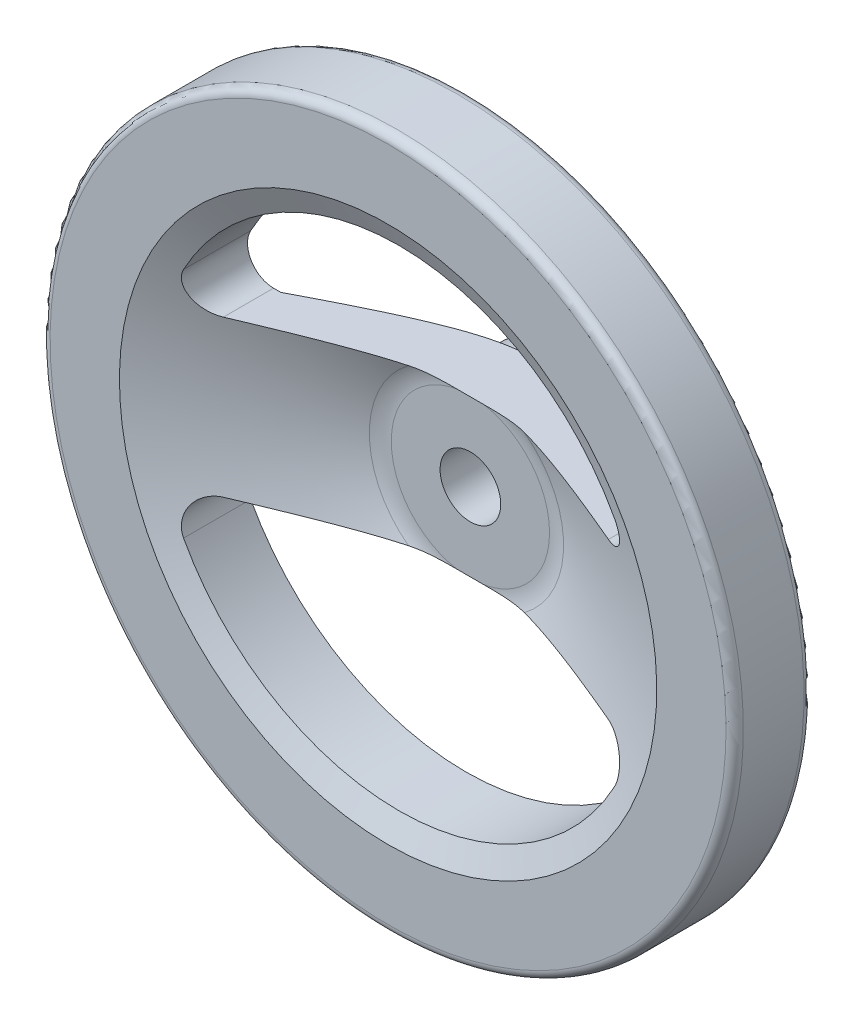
ISO-10303-21;
HEADER;
FILE_DESCRIPTION(('STEP AP214'),'2;1');
FILE_NAME('part.step','',(''),(''),'','','');
FILE_SCHEMA(('AUTOMOTIVE_DESIGN { 1 0 10303 214 1 1 1 1 }'));
ENDSEC;
DATA;
#1=APPLICATION_CONTEXT('core data for automotive mechanical design processes');
#2=APPLICATION_PROTOCOL_DEFINITION('international standard','automotive_design',2000,#1);
#3=PRODUCT_CONTEXT('',#1,'mechanical');
#4=PRODUCT('Part','Part','',(#3));
#5=PRODUCT_RELATED_PRODUCT_CATEGORY('part','',(#4));
#6=PRODUCT_DEFINITION_FORMATION('','',#4);
#7=PRODUCT_DEFINITION_CONTEXT('part definition',#1,'design');
#8=PRODUCT_DEFINITION('design','',#6,#7);
#9=PRODUCT_DEFINITION_SHAPE('','',#8);
#10=(LENGTH_UNIT() NAMED_UNIT(*) SI_UNIT(.MILLI.,.METRE.));
#11=(NAMED_UNIT(*) PLANE_ANGLE_UNIT() SI_UNIT($,.RADIAN.));
#12=(NAMED_UNIT(*) SI_UNIT($,.STERADIAN.) SOLID_ANGLE_UNIT());
#13=UNCERTAINTY_MEASURE_WITH_UNIT(LENGTH_MEASURE(1.E-05),#10,'distance_accuracy_value','');
#14=(GEOMETRIC_REPRESENTATION_CONTEXT(3) GLOBAL_UNCERTAINTY_ASSIGNED_CONTEXT((#13)) GLOBAL_UNIT_ASSIGNED_CONTEXT((#10,
#11,#12)) REPRESENTATION_CONTEXT('',''));
#15=CARTESIAN_POINT('',(0.,0.,0.));
#16=DIRECTION('',(0.,0.,1.));
#17=DIRECTION('',(1.,0.,0.));
#18=AXIS2_PLACEMENT_3D('',#15,#16,#17);
#19=CARTESIAN_POINT('',(-18.278680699,18.216,0.));
#20=DIRECTION('',(0.,0.,1.));
#21=DIRECTION('',(0.,-1.,0.));
#22=AXIS2_PLACEMENT_3D('',#19,#20,#21);
#23=PLANE('',#22);
#24=CARTESIAN_POINT('',(0.,0.,0.));
#25=DIRECTION('',(0.,0.,1.));
#26=DIRECTION('',(0.,-1.,0.));
#27=AXIS2_PLACEMENT_3D('',#24,#25,#26);
#28=CIRCLE('',#27,7.);
#29=CARTESIAN_POINT('',(0.,-7.,0.));
#30=VERTEX_POINT('',#29);
#31=EDGE_CURVE('E18',#30,#30,#28,.T.);
#32=ORIENTED_EDGE('',*,*,#31,.T.);
#33=EDGE_LOOP('',(#32));
#34=FACE_BOUND('',#33,.T.);
#35=CARTESIAN_POINT('',(0.,0.,0.));
#36=DIRECTION('',(0.,0.,-1.));
#37=DIRECTION('',(0.,1.,0.));
#38=AXIS2_PLACEMENT_3D('',#35,#36,#37);
#39=CIRCLE('',#38,18.);
#40=CARTESIAN_POINT('',(0.,18.,0.));
#41=VERTEX_POINT('',#40);
#42=EDGE_CURVE('E401',#41,#41,#39,.F.);
#43=ORIENTED_EDGE('',*,*,#42,.F.);
#44=EDGE_LOOP('',(#43));
#45=FACE_BOUND('',#44,.T.);
#46=ADVANCED_FACE('F14',(#34,#45),#23,.F.);
#47=CARTESIAN_POINT('',(0.,0.,0.));
#48=DIRECTION('',(0.,0.,1.));
#49=DIRECTION('',(0.,-1.,0.));
#50=AXIS2_PLACEMENT_3D('',#47,#48,#49);
#51=CYLINDRICAL_SURFACE('',#50,7.);
#52=CARTESIAN_POINT('',(0.,0.,20.));
#53=DIRECTION('',(0.,0.,1.));
#54=DIRECTION('',(0.,-1.,0.));
#55=AXIS2_PLACEMENT_3D('',#52,#53,#54);
#56=CIRCLE('',#55,7.);
#57=CARTESIAN_POINT('',(0.,-7.,20.));
#58=VERTEX_POINT('',#57);
#59=EDGE_CURVE('E397',#58,#58,#56,.T.);
#60=ORIENTED_EDGE('',*,*,#59,.T.);
#61=EDGE_LOOP('',(#60));
#62=FACE_BOUND('',#61,.T.);
#63=ORIENTED_EDGE('',*,*,#31,.F.);
#64=EDGE_LOOP('',(#63));
#65=FACE_BOUND('',#64,.T.);
#66=ADVANCED_FACE('F529',(#62,#65),#51,.F.);
#67=CARTESIAN_POINT('',(0.,0.,37.0005));
#68=DIRECTION('',(0.,0.,-1.));
#69=DIRECTION('',(0.,1.,0.));
#70=AXIS2_PLACEMENT_3D('',#67,#68,#69);
#71=TOROIDAL_SURFACE('',#70,78.,2.);
#72=CARTESIAN_POINT('',(0.,0.,37.0005));
#73=DIRECTION('',(0.,0.,-1.));
#74=DIRECTION('',(0.,1.,0.));
#75=AXIS2_PLACEMENT_3D('',#72,#73,#74);
#76=CIRCLE('',#75,80.);
#77=CARTESIAN_POINT('',(0.,80.,37.0005));
#78=VERTEX_POINT('',#77);
#79=EDGE_CURVE('E403',#78,#78,#76,.T.);
#80=ORIENTED_EDGE('',*,*,#79,.F.);
#81=EDGE_LOOP('',(#80));
#82=FACE_BOUND('',#81,.T.);
#83=CARTESIAN_POINT('',(0.,0.,39.0005));
#84=DIRECTION('',(0.,0.,-1.));
#85=DIRECTION('',(0.,1.,0.));
#86=AXIS2_PLACEMENT_3D('',#83,#84,#85);
#87=CIRCLE('',#86,77.999999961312);
#88=CARTESIAN_POINT('',(0.,77.999999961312,39.0005));
#89=VERTEX_POINT('',#88);
#90=EDGE_CURVE('E137',#89,#89,#87,.T.);
#91=ORIENTED_EDGE('',*,*,#90,.T.);
#92=EDGE_LOOP('',(#91));
#93=FACE_BOUND('',#92,.T.);
#94=ADVANCED_FACE('F376',(#82,#93),#71,.T.);
#95=CARTESIAN_POINT('',(0.,0.,37.0005));
#96=DIRECTION('',(0.,0.,-1.));
#97=DIRECTION('',(0.,1.,0.));
#98=AXIS2_PLACEMENT_3D('',#95,#96,#97);
#99=CYLINDRICAL_SURFACE('',#98,80.);
#100=CARTESIAN_POINT('',(0.,0.,23.0005));
#101=DIRECTION('',(0.,0.,-1.));
#102=DIRECTION('',(0.,1.,0.));
#103=AXIS2_PLACEMENT_3D('',#100,#101,#102);
#104=CIRCLE('',#103,80.);
#105=CARTESIAN_POINT('',(0.,80.,23.0005));
#106=VERTEX_POINT('',#105);
#107=EDGE_CURVE('E468',#106,#106,#104,.T.);
#108=ORIENTED_EDGE('',*,*,#107,.F.);
#109=EDGE_LOOP('',(#108));
#110=FACE_BOUND('',#109,.T.);
#111=ORIENTED_EDGE('',*,*,#79,.T.);
#112=EDGE_LOOP('',(#111));
#113=FACE_BOUND('',#112,.T.);
#114=ADVANCED_FACE('F521',(#110,#113),#99,.T.);
#115=CARTESIAN_POINT('',(0.,0.,4.929222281));
#116=DIRECTION('',(0.,0.,-1.));
#117=DIRECTION('',(0.,1.,0.));
#118=AXIS2_PLACEMENT_3D('',#115,#116,#117);
#119=CYLINDRICAL_SURFACE('',#118,18.);
#120=ORIENTED_EDGE('',*,*,#42,.T.);
#121=EDGE_LOOP('',(#120));
#122=FACE_BOUND('',#121,.T.);
#123=CARTESIAN_POINT('',(0.,0.,4.92922228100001));
#124=DIRECTION('',(0.,0.,1.));
#125=DIRECTION('',(0.,-1.,0.));
#126=AXIS2_PLACEMENT_3D('',#123,#124,#125);
#127=CIRCLE('',#126,18.);
#128=CARTESIAN_POINT('',(-3.69186171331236E-09,-18.,4.92922228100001));
#129=VERTEX_POINT('',#128);
#130=CARTESIAN_POINT('',(-3.69186171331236E-09,18.,4.92922228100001));
#131=VERTEX_POINT('',#130);
#132=EDGE_CURVE('E471',#129,#131,#127,.T.);
#133=ORIENTED_EDGE('',*,*,#132,.F.);
#134=CARTESIAN_POINT('',(0.,0.,4.92922228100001));
#135=DIRECTION('',(0.,0.,1.));
#136=DIRECTION('',(0.,-1.,0.));
#137=AXIS2_PLACEMENT_3D('',#134,#135,#136);
#138=CIRCLE('',#137,18.);
#139=EDGE_CURVE('E469',#131,#129,#138,.T.);
#140=ORIENTED_EDGE('',*,*,#139,.F.);
#141=EDGE_LOOP('',(#133,#140));
#142=FACE_BOUND('',#141,.T.);
#143=ADVANCED_FACE('F425',(#122,#142),#119,.T.);
#144=CARTESIAN_POINT('',(-2.761528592,-18.049017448,20.));
#145=CARTESIAN_POINT('',(-30.157500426,-13.857389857,20.));
#146=CARTESIAN_POINT('',(-30.157500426,13.857389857,20.));
#147=CARTESIAN_POINT('',(-2.761528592,18.049017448,20.));
#148=CARTESIAN_POINT('',(-2.979364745,-19.47276824,20.));
#149=CARTESIAN_POINT('',(-32.536398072,-14.950494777,20.));
#150=CARTESIAN_POINT('',(-32.536398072,14.950494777,20.));
#151=CARTESIAN_POINT('',(-2.979364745,19.47276824,20.));
#152=CARTESIAN_POINT('',(-3.19221388,-20.863924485,20.30642855));
#153=CARTESIAN_POINT('',(-34.860834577,-16.018574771,20.30642855));
#154=CARTESIAN_POINT('',(-34.860834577,16.018574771,20.30642855));
#155=CARTESIAN_POINT('',(-3.19221388,20.863924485,20.30642855));
#156=CARTESIAN_POINT('',(-3.390330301,-22.15878949,20.905255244));
#157=CARTESIAN_POINT('',(-37.024381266,-17.012725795,20.905255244));
#158=CARTESIAN_POINT('',(-37.024381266,17.012725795,20.905255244));
#159=CARTESIAN_POINT('',(-3.390330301,22.15878949,20.905255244));
#160=(BOUNDED_SURFACE() B_SPLINE_SURFACE(3,3,((#144,#145,#146,#147),(#148,#149,#150,#151),(#152,
#153,#154,#155),(#156,#157,#158,#159)),.UNSPECIFIED.,.F.,.F.,
.F.) B_SPLINE_SURFACE_WITH_KNOTS((4,4),(4,4),(0.,1.),(0.,1.),
.UNSPECIFIED.) GEOMETRIC_REPRESENTATION_ITEM() RATIONAL_B_SPLINE_SURFACE(((1.,0.43416106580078,
0.43416106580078,1.),(0.984737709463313,0.427534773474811,0.427534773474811,0.984737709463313),
(0.984737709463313,0.427534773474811,0.427534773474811,0.984737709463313),(1.,0.43416106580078,
0.43416106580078,1.))) REPRESENTATION_ITEM('') SURFACE());
#161=CARTESIAN_POINT('',(-13.3606246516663,-18.,20.9052552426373));
#162=CARTESIAN_POINT('',(-13.0440302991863,-18.,20.8190016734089));
#163=CARTESIAN_POINT('',(-12.725261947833,-18.,20.7412157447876));
#164=CARTESIAN_POINT('',(-12.0849421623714,-18.,20.600944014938));
#165=CARTESIAN_POINT('',(-11.7633965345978,-18.,20.5384318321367));
#166=CARTESIAN_POINT('',(-10.7547571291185,-18.,20.3639529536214));
#167=CARTESIAN_POINT('',(-10.0635707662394,-18.,20.2755160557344));
#168=CARTESIAN_POINT('',(-9.02335100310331,-18.,20.1757334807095));
#169=CARTESIAN_POINT('',(-8.67564350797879,-18.,20.1479386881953));
#170=CARTESIAN_POINT('',(-7.97961967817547,-18.,20.1013578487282));
#171=CARTESIAN_POINT('',(-7.63130337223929,-18.,20.0825713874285));
#172=CARTESIAN_POINT('',(-6.93088158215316,-18.,20.051931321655));
#173=CARTESIAN_POINT('',(-6.57877319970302,-18.,20.040149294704));
#174=CARTESIAN_POINT('',(-5.87440844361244,-18.,20.0219594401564));
#175=CARTESIAN_POINT('',(-5.52215206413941,-18.,20.0155518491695));
#176=CARTESIAN_POINT('',(-4.81902615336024,-18.,20.0064437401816));
#177=CARTESIAN_POINT('',(-4.46815679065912,-18.,20.0037282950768));
#178=CARTESIAN_POINT('',(-3.94187229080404,-18.,20.0013138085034));
#179=CARTESIAN_POINT('',(-3.7664598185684,-18.,20.0007854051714));
#180=CARTESIAN_POINT('',(-3.41563545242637,-18.,20.0001297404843));
#181=CARTESIAN_POINT('',(-3.24022355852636,-18.,20.00000247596));
#182=CARTESIAN_POINT('',(-3.06481174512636,-18.,20.));
#183=B_SPLINE_CURVE_WITH_KNOTS('',3,(#161,#162,#163,#164,#165,#166,#167,#168,#169,#170,#171,
#172,#173,#174,#175,#176,#177,#178,#179,#180,#181,#182),.UNSPECIFIED.,.F.,.F.,(4,2,2,2,2,2,2,2,
2,2,4),(0.,0.9840847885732,1.96645760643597,4.05452901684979,5.10092832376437,6.14727949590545,
7.20414718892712,8.2610614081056,9.31368975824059,9.83992931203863,10.366164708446),.UNSPECIFIED.);
#184=CARTESIAN_POINT('',(-13.3606246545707,-18.,20.9052552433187));
#185=VERTEX_POINT('',#184);
#186=CARTESIAN_POINT('',(-3.06481174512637,-17.999999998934,19.9999999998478));
#187=VERTEX_POINT('',#186);
#188=EDGE_CURVE('E441',#185,#187,#183,.T.);
#189=CARTESIAN_POINT('',(-2.761528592,-18.049017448,20.));
#190=CARTESIAN_POINT('',(-30.157500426,-13.857389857,20.));
#191=CARTESIAN_POINT('',(-30.157500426,13.857389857,20.));
#192=CARTESIAN_POINT('',(-2.761528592,18.049017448,20.));
#193=(BOUNDED_CURVE() B_SPLINE_CURVE(3,(#189,#190,#191,#192),.UNSPECIFIED.,.F.,
.F.) B_SPLINE_CURVE_WITH_KNOTS((4,4),(0.,1.),
.UNSPECIFIED.) CURVE() GEOMETRIC_REPRESENTATION_ITEM() RATIONAL_B_SPLINE_CURVE((1.,
0.43416106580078,0.43416106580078,1.)) REPRESENTATION_ITEM(''));
#194=CARTESIAN_POINT('',(-3.06481174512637,17.999999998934,19.9999999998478));
#195=VERTEX_POINT('',#194);
#196=EDGE_CURVE('E399',#187,#195,#193,.T.);
#197=CARTESIAN_POINT('',(-3.06481174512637,18.,20.));
#198=CARTESIAN_POINT('',(-3.39168435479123,18.,20.0000357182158));
#199=CARTESIAN_POINT('',(-3.71856241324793,18.,20.0004517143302));
#200=CARTESIAN_POINT('',(-4.37234646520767,18.,20.0031566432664));
#201=CARTESIAN_POINT('',(-4.69925245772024,18.,20.0054457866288));
#202=CARTESIAN_POINT('',(-5.35384378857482,18.,20.0130192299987));
#203=CARTESIAN_POINT('',(-5.68152905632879,18.,20.0183109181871));
#204=CARTESIAN_POINT('',(-6.3367889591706,18.,20.0332375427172));
#205=CARTESIAN_POINT('',(-6.66436359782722,18.,20.0428723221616));
#206=CARTESIAN_POINT('',(-7.52536079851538,18.,20.0758211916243));
#207=CARTESIAN_POINT('',(-8.05862547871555,18.,20.103927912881));
#208=CARTESIAN_POINT('',(-9.12290351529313,18.,20.1823470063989));
#209=CARTESIAN_POINT('',(-9.65391889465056,18.,20.232630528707));
#210=CARTESIAN_POINT('',(-10.7180329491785,18.,20.3634229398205));
#211=CARTESIAN_POINT('',(-11.2510958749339,18.,20.4442406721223));
#212=CARTESIAN_POINT('',(-12.0460667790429,18.,20.5940198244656));
#213=CARTESIAN_POINT('',(-12.3106588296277,18.,20.6488031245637));
#214=CARTESIAN_POINT('',(-12.8375428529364,18.,20.7688925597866));
#215=CARTESIAN_POINT('',(-13.0998339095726,18.,20.8342027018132));
#216=CARTESIAN_POINT('',(-13.3606246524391,18.,20.905255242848));
#217=B_SPLINE_CURVE_WITH_KNOTS('',3,(#197,#198,#199,#200,#201,#202,#203,#204,#205,#206,#207,
#208,#209,#210,#211,#212,#213,#214,#215,#216),.UNSPECIFIED.,.F.,.F.,(4,2,2,2,2,2,2,2,2,4),(0.,
0.980625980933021,1.9613621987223,2.94452218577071,3.92764665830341,5.52931973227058,
7.1289152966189,8.74514327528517,9.55556159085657,10.3662891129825),.UNSPECIFIED.);
#218=CARTESIAN_POINT('',(-13.3606246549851,18.,20.9052552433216));
#219=VERTEX_POINT('',#218);
#220=EDGE_CURVE('E148',#195,#219,#217,.T.);
#221=CARTESIAN_POINT('',(0.,0.,20.905255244));
#222=DIRECTION('',(0.,0.,1.));
#223=DIRECTION('',(0.,-1.,0.));
#224=AXIS2_PLACEMENT_3D('',#221,#222,#223);
#225=CIRCLE('',#224,22.416652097);
#226=EDGE_CURVE('E136',#219,#185,#225,.T.);
#227=ORIENTED_EDGE('',*,*,#188,.T.);
#228=ORIENTED_EDGE('',*,*,#196,.T.);
#229=ORIENTED_EDGE('',*,*,#220,.T.);
#230=ORIENTED_EDGE('',*,*,#226,.T.);
#231=EDGE_LOOP('',(#227,#228,#229,#230));
#232=FACE_BOUND('',#231,.T.);
#233=ADVANCED_FACE('F374',(#232),#160,.F.);
#234=CARTESIAN_POINT('',(-18.598734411,-18.,20.));
#235=DIRECTION('',(0.,0.,-1.));
#236=DIRECTION('',(0.,1.,0.));
#237=AXIS2_PLACEMENT_3D('',#234,#235,#236);
#238=PLANE('',#237);
#239=ORIENTED_EDGE('',*,*,#59,.F.);
#240=EDGE_LOOP('',(#239));
#241=FACE_BOUND('',#240,.T.);
#242=DIRECTION('',(1.,0.,0.));
#243=VECTOR('',#242,1.);
#244=CARTESIAN_POINT('',(0.,-18.,19.9999999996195));
#245=LINE('',#244,#243);
#246=CARTESIAN_POINT('',(3.06481174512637,-17.999999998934,19.9999999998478));
#247=VERTEX_POINT('',#246);
#248=EDGE_CURVE('E131',#187,#247,#245,.T.);
#249=ORIENTED_EDGE('',*,*,#248,.T.);
#250=CARTESIAN_POINT('',(2.761528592,18.049017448,20.));
#251=CARTESIAN_POINT('',(30.157500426,13.857389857,20.));
#252=CARTESIAN_POINT('',(30.157500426,-13.857389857,20.));
#253=CARTESIAN_POINT('',(2.761528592,-18.049017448,20.));
#254=(BOUNDED_CURVE() B_SPLINE_CURVE(3,(#250,#251,#252,#253),.UNSPECIFIED.,.F.,
.F.) B_SPLINE_CURVE_WITH_KNOTS((4,4),(0.,1.),
.UNSPECIFIED.) CURVE() GEOMETRIC_REPRESENTATION_ITEM() RATIONAL_B_SPLINE_CURVE((1.,
0.43416106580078,0.43416106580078,1.)) REPRESENTATION_ITEM(''));
#255=CARTESIAN_POINT('',(3.06481174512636,17.999999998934,19.9999999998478));
#256=VERTEX_POINT('',#255);
#257=EDGE_CURVE('E125',#247,#256,#254,.F.);
#258=ORIENTED_EDGE('',*,*,#257,.T.);
#259=DIRECTION('',(-1.,0.,0.));
#260=VECTOR('',#259,1.);
#261=CARTESIAN_POINT('',(0.,18.,19.9999999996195));
#262=LINE('',#261,#260);
#263=EDGE_CURVE('E129',#256,#195,#262,.T.);
#264=ORIENTED_EDGE('',*,*,#263,.T.);
#265=ORIENTED_EDGE('',*,*,#196,.F.);
#266=EDGE_LOOP('',(#249,#258,#264,#265));
#267=FACE_BOUND('',#266,.T.);
#268=ADVANCED_FACE('F128',(#241,#267),#238,.F.);
#269=CARTESIAN_POINT('',(-79.207616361,-78.936,39.0005));
#270=DIRECTION('',(0.,0.,-1.));
#271=DIRECTION('',(0.,1.,0.));
#272=AXIS2_PLACEMENT_3D('',#269,#270,#271);
#273=PLANE('',#272);
#274=CARTESIAN_POINT('',(0.,0.,39.0005));
#275=DIRECTION('',(0.,0.,1.));
#276=DIRECTION('',(0.,-1.,0.));
#277=AXIS2_PLACEMENT_3D('',#274,#275,#276);
#278=CIRCLE('',#277,62.);
#279=CARTESIAN_POINT('',(0.,-62.,39.0005));
#280=VERTEX_POINT('',#279);
#281=EDGE_CURVE('E393',#280,#280,#278,.F.);
#282=ORIENTED_EDGE('',*,*,#281,.T.);
#283=EDGE_LOOP('',(#282));
#284=FACE_BOUND('',#283,.T.);
#285=ORIENTED_EDGE('',*,*,#90,.F.);
#286=EDGE_LOOP('',(#285));
#287=FACE_BOUND('',#286,.T.);
#288=ADVANCED_FACE('F373',(#284,#287),#273,.F.);
#289=CARTESIAN_POINT('',(2.761528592,18.049017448,20.));
#290=CARTESIAN_POINT('',(30.157500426,13.857389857,20.));
#291=CARTESIAN_POINT('',(30.157500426,-13.857389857,20.));
#292=CARTESIAN_POINT('',(2.761528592,-18.049017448,20.));
#293=CARTESIAN_POINT('',(2.979364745,19.47276824,20.));
#294=CARTESIAN_POINT('',(32.536398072,14.950494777,20.));
#295=CARTESIAN_POINT('',(32.536398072,-14.950494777,20.));
#296=CARTESIAN_POINT('',(2.979364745,-19.47276824,20.));
#297=CARTESIAN_POINT('',(3.19221388,20.863924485,20.30642855));
#298=CARTESIAN_POINT('',(34.860834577,16.018574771,20.30642855));
#299=CARTESIAN_POINT('',(34.860834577,-16.018574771,20.30642855));
#300=CARTESIAN_POINT('',(3.19221388,-20.863924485,20.30642855));
#301=CARTESIAN_POINT('',(3.390330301,22.15878949,20.905255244));
#302=CARTESIAN_POINT('',(37.024381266,17.012725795,20.905255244));
#303=CARTESIAN_POINT('',(37.024381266,-17.012725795,20.905255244));
#304=CARTESIAN_POINT('',(3.390330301,-22.15878949,20.905255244));
#305=(BOUNDED_SURFACE() B_SPLINE_SURFACE(3,3,((#289,#290,#291,#292),(#293,#294,#295,#296),(#297,
#298,#299,#300),(#301,#302,#303,#304)),.UNSPECIFIED.,.F.,.F.,
.F.) B_SPLINE_SURFACE_WITH_KNOTS((4,4),(4,4),(0.,1.),(0.,1.),
.UNSPECIFIED.) GEOMETRIC_REPRESENTATION_ITEM() RATIONAL_B_SPLINE_SURFACE(((1.,0.43416106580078,
0.43416106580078,1.),(0.984737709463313,0.427534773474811,0.427534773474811,0.984737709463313),
(0.984737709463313,0.427534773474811,0.427534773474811,0.984737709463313),(1.,0.43416106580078,
0.43416106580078,1.))) REPRESENTATION_ITEM('') SURFACE());
#306=CARTESIAN_POINT('',(3.06481174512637,-18.,20.));
#307=CARTESIAN_POINT('',(3.39168435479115,-18.,20.0000357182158));
#308=CARTESIAN_POINT('',(3.71856241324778,-18.,20.0004517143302));
#309=CARTESIAN_POINT('',(4.37234646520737,-18.,20.0031566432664));
#310=CARTESIAN_POINT('',(4.69925245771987,-18.,20.0054457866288));
#311=CARTESIAN_POINT('',(5.35384378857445,-18.,20.0130192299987));
#312=CARTESIAN_POINT('',(5.68152905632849,-18.,20.0183109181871));
#313=CARTESIAN_POINT('',(6.33678895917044,-18.,20.0332375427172));
#314=CARTESIAN_POINT('',(6.66436359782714,-18.,20.0428723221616));
#315=CARTESIAN_POINT('',(7.5253607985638,-18.,20.0758211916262));
#316=CARTESIAN_POINT('',(8.05862547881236,-18.,20.1039279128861));
#317=CARTESIAN_POINT('',(9.12290351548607,-18.,20.1823470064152));
#318=CARTESIAN_POINT('',(9.65391889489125,-18.,20.2326305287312));
#319=CARTESIAN_POINT('',(10.7180329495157,-18.,20.3634229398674));
#320=CARTESIAN_POINT('',(11.2510958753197,-18.,20.4442406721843));
#321=CARTESIAN_POINT('',(12.0460667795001,-18.,20.5940198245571));
#322=CARTESIAN_POINT('',(12.3106588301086,-18.,20.6488031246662));
#323=CARTESIAN_POINT('',(12.8375428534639,-18.,20.7688925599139));
#324=CARTESIAN_POINT('',(13.0998339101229,-18.,20.8342027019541));
#325=CARTESIAN_POINT('',(13.3606246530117,-18.,20.9052552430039));
#326=B_SPLINE_CURVE_WITH_KNOTS('',3,(#306,#307,#308,#309,#310,#311,#312,#313,#314,#315,#316,
#317,#318,#319,#320,#321,#322,#323,#324,#325),.UNSPECIFIED.,.F.,.F.,(4,2,2,2,2,2,2,2,2,4),(0.,
0.980625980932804,1.96136219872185,2.94452218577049,3.92764665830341,5.52931973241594,
7.12891529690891,8.74514327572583,9.55556159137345,10.3662891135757),.UNSPECIFIED.);
#327=CARTESIAN_POINT('',(13.3606246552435,-18.,20.9052552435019));
#328=VERTEX_POINT('',#327);
#329=EDGE_CURVE('E450',#247,#328,#326,.T.);
#330=CARTESIAN_POINT('',(0.,0.,20.905255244));
#331=DIRECTION('',(0.,0.,1.));
#332=DIRECTION('',(0.,-1.,0.));
#333=AXIS2_PLACEMENT_3D('',#330,#331,#332);
#334=CIRCLE('',#333,22.416652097);
#335=CARTESIAN_POINT('',(13.3606246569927,18.,20.9052552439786));
#336=VERTEX_POINT('',#335);
#337=EDGE_CURVE('E153',#328,#336,#334,.T.);
#338=CARTESIAN_POINT('',(13.3606246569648,18.,20.905255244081));
#339=CARTESIAN_POINT('',(13.0440303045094,18.,20.819001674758));
#340=CARTESIAN_POINT('',(12.7252619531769,18.,20.741215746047));
#341=CARTESIAN_POINT('',(12.0849421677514,18.,20.600944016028));
#342=CARTESIAN_POINT('',(11.7633965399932,18.,20.5384318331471));
#343=CARTESIAN_POINT('',(10.7547571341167,18.,20.3639529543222));
#344=CARTESIAN_POINT('',(10.0635707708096,18.,20.275516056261));
#345=CARTESIAN_POINT('',(9.02335100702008,18.,20.1757334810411));
#346=CARTESIAN_POINT('',(8.67564351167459,18.,20.1479386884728));
#347=CARTESIAN_POINT('',(7.97961968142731,18.,20.1013578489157));
#348=CARTESIAN_POINT('',(7.63130337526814,18.,20.08257138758));
#349=CARTESIAN_POINT('',(6.93088158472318,18.,20.0519313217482));
#350=CARTESIAN_POINT('',(6.57877320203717,18.,20.040149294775));
#351=CARTESIAN_POINT('',(5.87440844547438,18.,20.0219594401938));
#352=CARTESIAN_POINT('',(5.52215206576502,18.,20.0155518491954));
#353=CARTESIAN_POINT('',(4.81902615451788,18.,20.0064437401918));
#354=CARTESIAN_POINT('',(4.46815679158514,18.,20.0037282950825));
#355=CARTESIAN_POINT('',(3.94187229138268,18.,20.0013138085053));
#356=CARTESIAN_POINT('',(3.76645981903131,18.,20.0007854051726));
#357=CARTESIAN_POINT('',(3.41563545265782,18.,20.0001297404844));
#358=CARTESIAN_POINT('',(3.24022355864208,18.,20.00000247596));
#359=CARTESIAN_POINT('',(3.06481174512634,18.,20.));
#360=B_SPLINE_CURVE_WITH_KNOTS('',3,(#338,#339,#340,#341,#342,#343,#344,#345,#346,#347,#348,
#349,#350,#351,#352,#353,#354,#355,#356,#357,#358,#359),.UNSPECIFIED.,.F.,.F.,(4,2,2,2,2,2,2,2,
2,2,4),(0.,0.984084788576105,1.96645760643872,4.05452901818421,5.10092832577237,
6.14727949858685,7.20414719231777,8.26106141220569,9.3136897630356,9.83992931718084,
10.3661647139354),.UNSPECIFIED.);
#361=EDGE_CURVE('E145',#336,#256,#360,.T.);
#362=ORIENTED_EDGE('',*,*,#329,.T.);
#363=ORIENTED_EDGE('',*,*,#337,.T.);
#364=ORIENTED_EDGE('',*,*,#361,.T.);
#365=ORIENTED_EDGE('',*,*,#257,.F.);
#366=EDGE_LOOP('',(#362,#363,#364,#365));
#367=FACE_BOUND('',#366,.T.);
#368=ADVANCED_FACE('F151',(#367),#305,.F.);
#369=CARTESIAN_POINT('',(0.,0.,23.0005));
#370=DIRECTION('',(0.,0.,-1.));
#371=DIRECTION('',(0.,1.,0.));
#372=AXIS2_PLACEMENT_3D('',#369,#370,#371);
#373=TOROIDAL_SURFACE('',#372,78.,2.);
#374=CARTESIAN_POINT('',(0.,0.,21.0005));
#375=DIRECTION('',(0.,0.,-1.));
#376=DIRECTION('',(0.,1.,0.));
#377=AXIS2_PLACEMENT_3D('',#374,#375,#376);
#378=CIRCLE('',#377,77.999999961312);
#379=CARTESIAN_POINT('',(0.,77.999999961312,21.0005));
#380=VERTEX_POINT('',#379);
#381=EDGE_CURVE('E276',#380,#380,#378,.F.);
#382=ORIENTED_EDGE('',*,*,#381,.T.);
#383=EDGE_LOOP('',(#382));
#384=FACE_BOUND('',#383,.T.);
#385=ORIENTED_EDGE('',*,*,#107,.T.);
#386=EDGE_LOOP('',(#385));
#387=FACE_BOUND('',#386,.T.);
#388=ADVANCED_FACE('F190',(#384,#387),#373,.T.);
#389=CARTESIAN_POINT('',(-44.432533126,-24.,21.0005));
#390=DIRECTION('',(0.,0.,1.));
#391=DIRECTION('',(0.,-1.,0.));
#392=AXIS2_PLACEMENT_3D('',#389,#390,#391);
#393=CYLINDRICAL_SURFACE('',#392,6.);
#394=CARTESIAN_POINT('',(-49.7116459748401,-26.8514851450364,36.4862142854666));
#395=CARTESIAN_POINT('',(-49.7874648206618,-26.7111676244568,36.4862223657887));
#396=CARTESIAN_POINT('',(-49.8576441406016,-26.5678116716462,36.4836162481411));
#397=CARTESIAN_POINT('',(-49.9863095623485,-26.2761567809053,36.4732349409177));
#398=CARTESIAN_POINT('',(-50.044797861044,-26.1278587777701,36.4654607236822));
#399=CARTESIAN_POINT('',(-50.1495594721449,-25.827790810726,36.4448293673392));
#400=CARTESIAN_POINT('',(-50.1958641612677,-25.6760308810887,36.4319855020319));
#401=CARTESIAN_POINT('',(-50.2762234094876,-25.3697951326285,36.4013262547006));
#402=CARTESIAN_POINT('',(-50.3102777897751,-25.2153192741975,36.3835108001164));
#403=CARTESIAN_POINT('',(-50.3660076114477,-24.9048463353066,36.3430643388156));
#404=CARTESIAN_POINT('',(-50.3876883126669,-24.7488499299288,36.3204353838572));
#405=CARTESIAN_POINT('',(-50.4187084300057,-24.4363193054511,36.270530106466));
#406=CARTESIAN_POINT('',(-50.4280432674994,-24.2797849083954,36.2432520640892));
#407=CARTESIAN_POINT('',(-50.4344784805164,-23.9673216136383,36.1842677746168));
#408=CARTESIAN_POINT('',(-50.4315801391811,-23.8113926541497,36.1525619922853));
#409=CARTESIAN_POINT('',(-50.4137747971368,-23.5010878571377,36.0849424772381));
#410=CARTESIAN_POINT('',(-50.398863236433,-23.3467126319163,36.0490271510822));
#411=CARTESIAN_POINT('',(-50.3567447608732,-23.0361801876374,35.9721710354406));
#412=CARTESIAN_POINT('',(-50.3292012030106,-22.8800965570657,35.9311166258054));
#413=CARTESIAN_POINT('',(-50.2621646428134,-22.5715906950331,35.8451183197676));
#414=CARTESIAN_POINT('',(-50.2226673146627,-22.4191698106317,35.8001730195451));
#415=CARTESIAN_POINT('',(-50.0869476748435,-21.9688090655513,35.6599490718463));
#416=CARTESIAN_POINT('',(-49.9734691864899,-21.6775668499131,35.5592316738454));
#417=CARTESIAN_POINT('',(-49.6956681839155,-21.1001214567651,35.3383915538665));
#418=CARTESIAN_POINT('',(-49.5283289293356,-20.8157161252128,35.2174019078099));
#419=CARTESIAN_POINT('',(-49.1523092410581,-20.2810565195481,34.9647512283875));
#420=CARTESIAN_POINT('',(-48.9436206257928,-20.0308090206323,34.8330880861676));
#421=CARTESIAN_POINT('',(-48.4735944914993,-19.5512702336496,34.5514911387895));
#422=CARTESIAN_POINT('',(-48.2094226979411,-19.3251280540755,34.4009329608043));
#423=CARTESIAN_POINT('',(-47.6479196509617,-18.9225350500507,34.0943168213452));
#424=CARTESIAN_POINT('',(-47.3505603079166,-18.7461267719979,33.9382542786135));
#425=CARTESIAN_POINT('',(-46.8765114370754,-18.5172649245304,33.6982615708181));
#426=CARTESIAN_POINT('',(-46.7086258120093,-18.4454770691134,33.6148245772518));
#427=CARTESIAN_POINT('',(-46.3669836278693,-18.3174714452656,33.4480683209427));
#428=CARTESIAN_POINT('',(-46.1932290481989,-18.2612484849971,33.364749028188));
#429=CARTESIAN_POINT('',(-45.8412905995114,-18.1648772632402,33.1989409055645));
#430=CARTESIAN_POINT('',(-45.6631137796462,-18.1247049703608,33.1164510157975));
#431=CARTESIAN_POINT('',(-45.3033299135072,-18.0607187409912,32.9528140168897));
#432=CARTESIAN_POINT('',(-45.1217249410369,-18.0368952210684,32.8716661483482));
#433=CARTESIAN_POINT('',(-44.854954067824,-18.0142931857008,32.7546304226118));
#434=CARTESIAN_POINT('',(-44.7706462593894,-18.0089371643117,32.7179560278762));
#435=CARTESIAN_POINT('',(-44.6017786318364,-18.0017931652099,32.6451328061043));
#436=CARTESIAN_POINT('',(-44.5172192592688,-18.0000007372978,32.6089833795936));
#437=CARTESIAN_POINT('',(-44.4325331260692,-18.,32.5731019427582));
#438=B_SPLINE_CURVE_WITH_KNOTS('',3,(#394,#395,#396,#397,#398,#399,#400,#401,#402,#403,#404,
#405,#406,#407,#408,#409,#410,#411,#412,#413,#414,#415,#416,#417,#418,#419,#420,#421,#422,#423,
#424,#425,#426,#427,#428,#429,#430,#431,#432,#433,#434,#435,#436,#437),.UNSPECIFIED.,.F.,.F.,(4,
2,2,2,2,2,2,2,2,2,2,2,2,2,2,2,2,2,2,2,2,4),(0.,0.478314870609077,0.95653977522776,
1.43352076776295,1.91050872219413,2.38729376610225,2.8642555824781,3.34116737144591,
3.81826027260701,4.30888102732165,4.79967954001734,5.78064655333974,6.83066628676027,
7.8808939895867,9.01289965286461,10.1458708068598,10.7475458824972,11.349020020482,
11.9495902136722,12.549808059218,12.8260336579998,13.1019140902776),.UNSPECIFIED.);
#439=CARTESIAN_POINT('',(-49.7116459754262,-26.8514851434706,36.4862142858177));
#440=VERTEX_POINT('',#439);
#441=CARTESIAN_POINT('',(-44.4325331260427,-18.,32.573101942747));
#442=VERTEX_POINT('',#441);
#443=EDGE_CURVE('E261',#440,#442,#438,.T.);
#444=ORIENTED_EDGE('',*,*,#443,.F.);
#445=DIRECTION('',(0.,0.,-1.));
#446=VECTOR('',#445,1.);
#447=CARTESIAN_POINT('',(-49.7116459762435,-26.8514851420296,28.743357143));
#448=LINE('',#447,#446);
#449=CARTESIAN_POINT('',(-49.7116459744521,-26.8514851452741,21.0005));
#450=VERTEX_POINT('',#449);
#451=EDGE_CURVE('E322',#440,#450,#448,.T.);
#452=ORIENTED_EDGE('',*,*,#451,.T.);
#453=CARTESIAN_POINT('',(-44.432533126,-24.,21.0005));
#454=DIRECTION('',(0.,0.,1.));
#455=DIRECTION('',(0.,-1.,0.));
#456=AXIS2_PLACEMENT_3D('',#453,#454,#455);
#457=CIRCLE('',#456,6.);
#458=CARTESIAN_POINT('',(-44.432533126,-17.999999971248,21.0005));
#459=VERTEX_POINT('',#458);
#460=EDGE_CURVE('E331',#450,#459,#457,.F.);
#461=ORIENTED_EDGE('',*,*,#460,.T.);
#462=DIRECTION('',(0.,0.,1.));
#463=VECTOR('',#462,1.);
#464=CARTESIAN_POINT('',(-44.432533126,-18.,18.751162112));
#465=LINE('',#464,#463);
#466=EDGE_CURVE('E298',#459,#442,#465,.T.);
#467=ORIENTED_EDGE('',*,*,#466,.T.);
#468=EDGE_LOOP('',(#444,#452,#461,#467));
#469=FACE_BOUND('',#468,.T.);
#470=ADVANCED_FACE('F303',(#469),#393,.F.);
#471=CARTESIAN_POINT('',(0.,0.,4.929222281));
#472=DIRECTION('',(0.,0.,1.));
#473=DIRECTION('',(0.,-1.,0.));
#474=AXIS2_PLACEMENT_3D('',#471,#472,#473);
#475=CONICAL_SURFACE('',#474,18.,1.05561732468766);
#476=CARTESIAN_POINT('',(0.,0.,21.0005));
#477=DIRECTION('',(0.,0.,1.));
#478=DIRECTION('',(0.,-1.,0.));
#479=AXIS2_PLACEMENT_3D('',#476,#477,#478);
#480=CIRCLE('',#479,46.385559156);
#481=CARTESIAN_POINT('',(-42.7506736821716,-17.999999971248,21.000500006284));
#482=VERTEX_POINT('',#481);
#483=CARTESIAN_POINT('',(-42.7506736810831,17.999999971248,21.000500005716));
#484=VERTEX_POINT('',#483);
#485=EDGE_CURVE('E339',#482,#484,#480,.F.);
#486=ORIENTED_EDGE('',*,*,#485,.T.);
#487=CARTESIAN_POINT('',(-42.750673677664,17.9999999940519,21.0005000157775));
#488=CARTESIAN_POINT('',(-42.1445983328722,17.9999999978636,20.6842500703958));
#489=CARTESIAN_POINT('',(-41.5381125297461,17.9999999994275,20.3687854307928));
#490=CARTESIAN_POINT('',(-40.3242108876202,18.0000000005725,19.7396451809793));
#491=CARTESIAN_POINT('',(-39.7167950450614,18.0000000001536,19.4259695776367));
#492=CARTESIAN_POINT('',(-38.5008706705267,17.9999999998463,18.800598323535));
#493=CARTESIAN_POINT('',(-37.8923620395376,17.999999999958,18.4889028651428));
#494=CARTESIAN_POINT('',(-36.6741817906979,18.000000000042,17.8677961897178));
#495=CARTESIAN_POINT('',(-36.0645101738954,18.0000000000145,17.5583849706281));
#496=CARTESIAN_POINT('',(-34.2293078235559,17.999999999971,16.6318848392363));
#497=CARTESIAN_POINT('',(-33.0017979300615,17.9999999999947,16.0186989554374));
#498=CARTESIAN_POINT('',(-31.1555002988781,18.0000000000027,15.1092070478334));
#499=CARTESIAN_POINT('',(-30.5392414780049,18.0000000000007,14.8077635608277));
#500=CARTESIAN_POINT('',(-29.3047934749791,17.9999999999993,14.2088575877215));
#501=CARTESIAN_POINT('',(-28.6866043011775,17.9999999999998,13.9113950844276));
#502=CARTESIAN_POINT('',(-27.4626152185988,18.0000000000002,13.3280538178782));
#503=CARTESIAN_POINT('',(-26.8568667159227,18.,13.0420672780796));
#504=CARTESIAN_POINT('',(-25.6429672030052,18.,12.4752449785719));
#505=CARTESIAN_POINT('',(-25.034816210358,18.,12.1944091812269));
#506=CARTESIAN_POINT('',(-23.8156664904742,18.,11.6387406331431));
#507=CARTESIAN_POINT('',(-23.2046673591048,18.,11.3639087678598));
#508=CARTESIAN_POINT('',(-21.9795035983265,18.,10.8213882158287));
#509=CARTESIAN_POINT('',(-21.3653389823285,18.,10.553699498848));
#510=CARTESIAN_POINT('',(-20.1339806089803,18.,10.0270729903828));
#511=CARTESIAN_POINT('',(-19.5167904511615,18.,9.76812680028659));
#512=CARTESIAN_POINT('',(-18.278231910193,18.,9.26035984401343));
#513=CARTESIAN_POINT('',(-17.6568634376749,18.,9.01153929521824));
#514=CARTESIAN_POINT('',(-16.4095317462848,18.,8.52613852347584));
#515=CARTESIAN_POINT('',(-15.7835697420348,18.,8.28955518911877));
#516=CARTESIAN_POINT('',(-14.5263052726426,18.,7.8310877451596));
#517=CARTESIAN_POINT('',(-13.8950031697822,18.,7.60920264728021));
#518=CARTESIAN_POINT('',(-12.7281317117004,18.,7.21735185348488));
#519=CARTESIAN_POINT('',(-12.1934444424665,18.,7.04476614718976));
#520=CARTESIAN_POINT('',(-11.1195332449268,18.,6.71426714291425));
#521=CARTESIAN_POINT('',(-10.5803093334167,18.,6.556353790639));
#522=CARTESIAN_POINT('',(-9.49779138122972,18.,6.25782625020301));
#523=CARTESIAN_POINT('',(-8.95450325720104,18.,6.11719072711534));
#524=CARTESIAN_POINT('',(-7.86314677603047,18.,5.85566578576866));
#525=CARTESIAN_POINT('',(-7.3150783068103,18.,5.73477683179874));
#526=CARTESIAN_POINT('',(-6.20936195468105,18.,5.51454327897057));
#527=CARTESIAN_POINT('',(-5.65167232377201,18.,5.41540683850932));
#528=CARTESIAN_POINT('',(-4.53232604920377,18.,5.24290532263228));
#529=CARTESIAN_POINT('',(-3.97066991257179,18.,5.16953701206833));
#530=CARTESIAN_POINT('',(-3.12470892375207,18.,5.08044036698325));
#531=CARTESIAN_POINT('',(-2.84148295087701,18.,5.05419786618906));
#532=CARTESIAN_POINT('',(-2.27444317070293,18.,5.00902915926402));
#533=CARTESIAN_POINT('',(-1.99062936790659,18.,4.9901028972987));
#534=CARTESIAN_POINT('',(-1.42245425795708,18.,4.95974071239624));
#535=CARTESIAN_POINT('',(-1.13809274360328,18.,4.94830866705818));
#536=CARTESIAN_POINT('',(-0.569155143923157,18.,4.93304297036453));
#537=CARTESIAN_POINT('',(-0.284579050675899,18.,4.92920961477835));
#538=CARTESIAN_POINT('',(-3.28969154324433E-09,18.,4.929222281));
#539=B_SPLINE_CURVE_WITH_KNOTS('',3,(#487,#488,#489,#490,#491,#492,#493,#494,#495,#496,#497,
#498,#499,#500,#501,#502,#503,#504,#505,#506,#507,#508,#509,#510,#511,#512,#513,#514,#515,#516,
#517,#518,#519,#520,#521,#522,#523,#524,#525,#526,#527,#528,#529,#530,#531,#532,#533,#534,#535,
#536,#537,#538),.UNSPECIFIED.,.F.,.F.,(4,2,2,2,2,2,2,2,2,2,2,2,2,2,2,2,2,2,2,2,2,2,2,2,2,4),(0.,
2.05087132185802,4.1017505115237,6.15282598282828,8.20389960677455,12.3202504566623,
14.3783425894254,16.4364258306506,18.4460013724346,20.4555622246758,22.4654174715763,
24.4752642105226,26.4831217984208,28.4910224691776,30.4984100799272,32.5056625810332,
34.1910386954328,35.8764085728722,37.5596759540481,39.2429829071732,40.9417563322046,
42.6403164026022,43.4935548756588,44.346786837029,45.2004599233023,46.0541662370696),.UNSPECIFIED.);
#540=EDGE_CURVE('E156',#484,#131,#539,.T.);
#541=ORIENTED_EDGE('',*,*,#540,.T.);
#542=ORIENTED_EDGE('',*,*,#139,.T.);
#543=CARTESIAN_POINT('',(-1.51661406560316E-09,-17.9999999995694,4.92922228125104));
#544=CARTESIAN_POINT('',(-0.264293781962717,-17.9999999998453,4.92921283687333));
#545=CARTESIAN_POINT('',(-0.528585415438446,-17.9999999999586,4.93251773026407));
#546=CARTESIAN_POINT('',(-1.05699776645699,-18.0000000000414,4.94568688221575));
#547=CARTESIAN_POINT('',(-1.32111848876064,-18.0000000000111,4.95555094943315));
#548=CARTESIAN_POINT('',(-1.84893254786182,-17.9999999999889,4.9817639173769));
#549=CARTESIAN_POINT('',(-2.11262601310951,-17.999999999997,4.99811022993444));
#550=CARTESIAN_POINT('',(-2.63953823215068,-18.000000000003,5.03715118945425));
#551=CARTESIAN_POINT('',(-2.9027569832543,-18.0000000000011,5.05984587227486));
#552=CARTESIAN_POINT('',(-3.68944150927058,-17.9999999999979,5.1370006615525));
#553=CARTESIAN_POINT('',(-4.21203150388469,-17.9999999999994,5.20063820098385));
#554=CARTESIAN_POINT('',(-5.25393792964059,-18.0000000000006,5.35064391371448));
#555=CARTESIAN_POINT('',(-5.77325404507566,-18.0000000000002,5.43701424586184));
#556=CARTESIAN_POINT('',(-6.80346116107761,-17.9999999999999,5.62944465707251));
#557=CARTESIAN_POINT('',(-7.31438607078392,-18.,5.73532430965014));
#558=CARTESIAN_POINT('',(-8.33215306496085,-18.,5.96501380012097));
#559=CARTESIAN_POINT('',(-8.83899521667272,-18.,6.08882334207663));
#560=CARTESIAN_POINT('',(-9.84906431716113,-18.,6.35229977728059));
#561=CARTESIAN_POINT('',(-10.3522871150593,-18.,6.49198250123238));
#562=CARTESIAN_POINT('',(-11.3547067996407,-18.,6.78504547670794));
#563=CARTESIAN_POINT('',(-11.8539036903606,-18.,6.93842571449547));
#564=CARTESIAN_POINT('',(-13.0062831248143,-18.,7.30757026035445));
#565=CARTESIAN_POINT('',(-13.6580692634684,-18.,7.52768740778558));
#566=CARTESIAN_POINT('',(-14.9557090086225,-18.,7.98483246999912));
#567=CARTESIAN_POINT('',(-15.6015620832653,-18.,8.22186188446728));
#568=CARTESIAN_POINT('',(-16.8881887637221,-18.,8.70991889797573));
#569=CARTESIAN_POINT('',(-17.528960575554,-18.,8.96095120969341));
#570=CARTESIAN_POINT('',(-18.8058446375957,-18.,9.47451133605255));
#571=CARTESIAN_POINT('',(-19.441957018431,-18.,9.73703882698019));
#572=CARTESIAN_POINT('',(-20.7111364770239,-18.,10.2720631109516));
#573=CARTESIAN_POINT('',(-21.3441972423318,-18.,10.5445748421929));
#574=CARTESIAN_POINT('',(-22.6068102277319,-18.,11.0976023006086));
#575=CARTESIAN_POINT('',(-23.2363624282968,-18.,11.3781180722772));
#576=CARTESIAN_POINT('',(-24.4923051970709,-18.,11.9458248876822));
#577=CARTESIAN_POINT('',(-25.1186963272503,-18.,12.2330146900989));
#578=CARTESIAN_POINT('',(-26.3688324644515,-18.,12.8130857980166));
#579=CARTESIAN_POINT('',(-26.9925774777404,-18.,13.1059670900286));
#580=CARTESIAN_POINT('',(-28.254252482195,-18.,13.7043971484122));
#581=CARTESIAN_POINT('',(-28.8921207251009,-18.,14.0100759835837));
#582=CARTESIAN_POINT('',(-30.1657468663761,-18.,14.6258015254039));
#583=CARTESIAN_POINT('',(-30.8015047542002,-18.,14.9358482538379));
#584=CARTESIAN_POINT('',(-32.7060942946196,-18.,15.8716232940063));
#585=CARTESIAN_POINT('',(-33.9721749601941,-18.,16.5029545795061));
#586=CARTESIAN_POINT('',(-35.8641398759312,-18.,17.4568964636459));
#587=CARTESIAN_POINT('',(-36.4921598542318,-18.,17.775291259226));
#588=CARTESIAN_POINT('',(-37.7469532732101,-18.,18.4145314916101));
#589=CARTESIAN_POINT('',(-38.3737267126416,-18.,18.7353769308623));
#590=CARTESIAN_POINT('',(-39.6260964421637,-18.,19.3791780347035));
#591=CARTESIAN_POINT('',(-40.2516928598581,-18.,19.7021334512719));
#592=CARTESIAN_POINT('',(-41.5018957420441,-18.,20.349948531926));
#593=CARTESIAN_POINT('',(-42.1265022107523,-18.,20.6748081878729));
#594=CARTESIAN_POINT('',(-42.7506736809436,-18.,21.0005000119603));
#595=B_SPLINE_CURVE_WITH_KNOTS('',3,(#543,#544,#545,#546,#547,#548,#549,#550,#551,#552,#553,
#554,#555,#556,#557,#558,#559,#560,#561,#562,#563,#564,#565,#566,#567,#568,#569,#570,#571,#572,
#573,#574,#575,#576,#577,#578,#579,#580,#581,#582,#583,#584,#585,#586,#587,#588,#589,#590,#591,
#592,#593,#594),.UNSPECIFIED.,.F.,.F.,(4,2,2,2,2,2,2,2,2,2,2,2,2,2,2,2,2,2,2,2,2,2,2,2,2,4),(0.,
0.792857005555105,1.58569088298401,2.37820852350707,3.17073064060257,4.74948530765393,
6.32838995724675,7.89336539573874,9.45831500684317,11.024839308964,12.5913620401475,
14.6549161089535,16.7186533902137,18.7830894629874,20.8474674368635,22.915071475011,
24.9826870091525,27.0499210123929,29.1171501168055,31.2391197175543,33.3610999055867,
37.6052824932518,39.7176384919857,41.8299966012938,43.9421107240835,46.0542158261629),.UNSPECIFIED.);
#596=EDGE_CURVE('E293',#129,#482,#595,.T.);
#597=ORIENTED_EDGE('',*,*,#596,.T.);
#598=EDGE_LOOP('',(#486,#541,#542,#597));
#599=FACE_BOUND('',#598,.T.);
#600=ADVANCED_FACE('F299',(#599),#475,.T.);
#601=CARTESIAN_POINT('',(-44.432533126,24.,21.0005));
#602=DIRECTION('',(0.,0.,1.));
#603=DIRECTION('',(0.,-1.,0.));
#604=AXIS2_PLACEMENT_3D('',#601,#602,#603);
#605=CYLINDRICAL_SURFACE('',#604,6.);
#606=CARTESIAN_POINT('',(-44.4325331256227,18.0000000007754,32.5731019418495));
#607=CARTESIAN_POINT('',(-44.6184537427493,17.999992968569,32.6518792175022));
#608=CARTESIAN_POINT('',(-44.8037956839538,18.0086407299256,32.7319573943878));
#609=CARTESIAN_POINT('',(-45.1720204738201,18.0428767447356,32.8940310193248));
#610=CARTESIAN_POINT('',(-45.3549038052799,18.0684616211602,32.9760260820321));
#611=CARTESIAN_POINT('',(-45.7169368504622,18.1361940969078,33.1412590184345));
#612=CARTESIAN_POINT('',(-45.8960875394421,18.1783373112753,33.2244965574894));
#613=CARTESIAN_POINT('',(-46.2495004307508,18.2787784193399,33.3916181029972));
#614=CARTESIAN_POINT('',(-46.4237624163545,18.337077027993,33.4755021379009));
#615=CARTESIAN_POINT('',(-46.766114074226,18.469352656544,33.6432767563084));
#616=CARTESIAN_POINT('',(-46.9342065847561,18.5433223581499,33.7271673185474));
#617=CARTESIAN_POINT('',(-47.2631806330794,18.7064984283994,33.8944489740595));
#618=CARTESIAN_POINT('',(-47.4240595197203,18.7957103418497,33.9778398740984));
#619=CARTESIAN_POINT('',(-47.7372948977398,18.9887742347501,34.143496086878));
#620=CARTESIAN_POINT('',(-47.889654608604,19.0926206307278,34.2257618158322));
#621=CARTESIAN_POINT('',(-48.1847761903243,19.3144099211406,34.3886712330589));
#622=CARTESIAN_POINT('',(-48.3275348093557,19.4323575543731,34.4693143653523));
#623=CARTESIAN_POINT('',(-48.6025302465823,19.6819351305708,34.6285874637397));
#624=CARTESIAN_POINT('',(-48.7347407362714,19.8135975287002,34.7072120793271));
#625=CARTESIAN_POINT('',(-48.9870316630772,20.089566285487,34.8616780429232));
#626=CARTESIAN_POINT('',(-49.1071127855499,20.2338719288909,34.937519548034));
#627=CARTESIAN_POINT('',(-49.333964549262,20.5342533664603,35.0858726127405));
#628=CARTESIAN_POINT('',(-49.4407322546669,20.6903317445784,35.1583834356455));
#629=CARTESIAN_POINT('',(-49.6396801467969,21.0131054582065,35.2994506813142));
#630=CARTESIAN_POINT('',(-49.7318673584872,21.1797956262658,35.3680089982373));
#631=CARTESIAN_POINT('',(-49.8960610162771,21.5135197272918,35.4970988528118));
#632=CARTESIAN_POINT('',(-49.9688800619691,21.680063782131,35.5578633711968));
#633=CARTESIAN_POINT('',(-50.0994875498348,22.020396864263,35.6748444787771));
#634=CARTESIAN_POINT('',(-50.1572831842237,22.1941823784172,35.7310632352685));
#635=CARTESIAN_POINT('',(-50.2570157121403,22.5477161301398,35.8384856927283));
#636=CARTESIAN_POINT('',(-50.2989560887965,22.7274630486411,35.8896904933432));
#637=CARTESIAN_POINT('',(-50.3662374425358,23.0914830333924,35.9866223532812));
#638=CARTESIAN_POINT('',(-50.3915800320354,23.2757556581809,36.0323499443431));
#639=CARTESIAN_POINT('',(-50.4236835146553,23.6319910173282,36.1143722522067));
#640=CARTESIAN_POINT('',(-50.431796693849,23.8037253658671,36.1511328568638));
#641=CARTESIAN_POINT('',(-50.4331736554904,24.1482990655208,36.2193335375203));
#642=CARTESIAN_POINT('',(-50.4264389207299,24.3211383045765,36.2507741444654));
#643=CARTESIAN_POINT('',(-50.3979259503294,24.666371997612,36.3080210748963));
#644=CARTESIAN_POINT('',(-50.3761604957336,24.8387667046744,36.3338321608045));
#645=CARTESIAN_POINT('',(-50.3175888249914,25.1816928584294,36.3795957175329));
#646=CARTESIAN_POINT('',(-50.2807866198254,25.352224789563,36.3995497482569));
#647=CARTESIAN_POINT('',(-50.1761073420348,25.7515647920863,36.4395712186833));
#648=CARTESIAN_POINT('',(-50.1017962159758,25.9790067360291,36.4570396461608));
#649=CARTESIAN_POINT('',(-49.9702894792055,26.3124840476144,36.4745300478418));
#650=CARTESIAN_POINT('',(-49.9231101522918,26.422369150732,36.4789081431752));
#651=CARTESIAN_POINT('',(-49.822227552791,26.6392208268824,36.4847504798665));
#652=CARTESIAN_POINT('',(-49.7685224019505,26.7461865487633,36.4862138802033));
#653=CARTESIAN_POINT('',(-49.711645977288,26.8514851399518,36.4862142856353));
#654=B_SPLINE_CURVE_WITH_KNOTS('',3,(#606,#607,#608,#609,#610,#611,#612,#613,#614,#615,#616,
#617,#618,#619,#620,#621,#622,#623,#624,#625,#626,#627,#628,#629,#630,#631,#632,#633,#634,#635,
#636,#637,#638,#639,#640,#641,#642,#643,#644,#645,#646,#647,#648,#649,#650,#651,#652,#653),
.UNSPECIFIED.,.F.,.F.,(4,2,2,2,2,2,2,2,2,2,2,2,2,2,2,2,2,2,2,2,2,2,2,4),(0.,0.605539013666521,
1.21095732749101,1.81621542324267,2.42150030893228,3.02650315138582,3.63172655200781,
4.23671966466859,4.84191666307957,5.44857984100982,6.05520872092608,6.66197113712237,
7.26844031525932,7.84265148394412,8.4165872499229,8.99039685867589,9.56415071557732,
10.0908969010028,10.6175904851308,11.1438367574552,11.6699427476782,12.387422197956,
12.7462088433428,13.1050989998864),.UNSPECIFIED.);
#655=CARTESIAN_POINT('',(-44.4325331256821,18.,32.5731019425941));
#656=VERTEX_POINT('',#655);
#657=CARTESIAN_POINT('',(-49.7116459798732,26.8514851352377,36.4862142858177));
#658=VERTEX_POINT('',#657);
#659=EDGE_CURVE('E253',#656,#658,#654,.T.);
#660=ORIENTED_EDGE('',*,*,#659,.F.);
#661=DIRECTION('',(0.,0.,-1.));
#662=VECTOR('',#661,1.);
#663=CARTESIAN_POINT('',(-44.432533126,18.,18.751162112));
#664=LINE('',#663,#662);
#665=CARTESIAN_POINT('',(-44.432533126,17.999999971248,21.0005));
#666=VERTEX_POINT('',#665);
#667=EDGE_CURVE('E223',#656,#666,#664,.T.);
#668=ORIENTED_EDGE('',*,*,#667,.T.);
#669=CARTESIAN_POINT('',(-44.432533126,24.,21.0005));
#670=DIRECTION('',(0.,0.,1.));
#671=DIRECTION('',(0.,-1.,0.));
#672=AXIS2_PLACEMENT_3D('',#669,#670,#671);
#673=CIRCLE('',#672,6.);
#674=CARTESIAN_POINT('',(-49.7116459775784,26.8514851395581,21.0005));
#675=VERTEX_POINT('',#674);
#676=EDGE_CURVE('E346',#666,#675,#673,.F.);
#677=ORIENTED_EDGE('',*,*,#676,.T.);
#678=DIRECTION('',(0.,0.,1.));
#679=VECTOR('',#678,1.);
#680=CARTESIAN_POINT('',(-49.711645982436,26.8514851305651,28.743357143));
#681=LINE('',#680,#679);
#682=EDGE_CURVE('E462',#675,#658,#681,.T.);
#683=ORIENTED_EDGE('',*,*,#682,.T.);
#684=EDGE_LOOP('',(#660,#668,#677,#683));
#685=FACE_BOUND('',#684,.T.);
#686=ADVANCED_FACE('F302',(#685),#605,.F.);
#687=CARTESIAN_POINT('',(0.,0.,21.0005));
#688=DIRECTION('',(0.,0.,1.));
#689=DIRECTION('',(0.,-1.,0.));
#690=AXIS2_PLACEMENT_3D('',#687,#688,#689);
#691=CYLINDRICAL_SURFACE('',#690,56.5);
#692=CARTESIAN_POINT('',(0.,0.,36.4862142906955));
#693=DIRECTION('',(0.,0.,1.));
#694=DIRECTION('',(0.,-1.,0.));
#695=AXIS2_PLACEMENT_3D('',#692,#693,#694);
#696=CIRCLE('',#695,56.5000000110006);
#697=CARTESIAN_POINT('',(49.7116459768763,26.8514851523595,36.4862142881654));
#698=VERTEX_POINT('',#697);
#699=EDGE_CURVE('E275',#698,#658,#696,.T.);
#700=ORIENTED_EDGE('',*,*,#699,.T.);
#701=ORIENTED_EDGE('',*,*,#682,.F.);
#702=CARTESIAN_POINT('',(0.,0.,21.0005));
#703=DIRECTION('',(0.,0.,1.));
#704=DIRECTION('',(0.,-1.,0.));
#705=AXIS2_PLACEMENT_3D('',#702,#703,#704);
#706=CIRCLE('',#705,56.5);
#707=CARTESIAN_POINT('',(49.7116459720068,26.8514851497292,21.0005));
#708=VERTEX_POINT('',#707);
#709=EDGE_CURVE('E349',#675,#708,#706,.F.);
#710=ORIENTED_EDGE('',*,*,#709,.T.);
#711=DIRECTION('',(0.,0.,1.));
#712=VECTOR('',#711,1.);
#713=CARTESIAN_POINT('',(49.7116459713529,26.8514851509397,28.7898142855));
#714=LINE('',#713,#712);
#715=EDGE_CURVE('E98',#708,#698,#714,.T.);
#716=ORIENTED_EDGE('',*,*,#715,.T.);
#717=EDGE_LOOP('',(#700,#701,#710,#716));
#718=FACE_BOUND('',#717,.T.);
#719=ADVANCED_FACE('F281',(#718),#691,.F.);
#720=CARTESIAN_POINT('',(44.432533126,24.,21.0005));
#721=DIRECTION('',(0.,0.,1.));
#722=DIRECTION('',(0.,-1.,0.));
#723=AXIS2_PLACEMENT_3D('',#720,#721,#722);
#724=CYLINDRICAL_SURFACE('',#723,6.);
#725=CARTESIAN_POINT('',(44.4325331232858,18.,32.5731019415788));
#726=CARTESIAN_POINT('',(44.6184537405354,17.9999929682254,32.6518792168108));
#727=CARTESIAN_POINT('',(44.8037956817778,18.0086407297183,32.7319573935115));
#728=CARTESIAN_POINT('',(45.1720204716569,18.0428767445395,32.8940310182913));
#729=CARTESIAN_POINT('',(45.3549038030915,18.0684616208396,32.9760260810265));
#730=CARTESIAN_POINT('',(45.7169368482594,18.1361940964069,33.141259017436));
#731=CARTESIAN_POINT('',(45.89608753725,18.1783373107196,33.2244965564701));
#732=CARTESIAN_POINT('',(46.2495004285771,18.2787784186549,33.391618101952));
#733=CARTESIAN_POINT('',(46.4237624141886,18.3370770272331,33.4755021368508));
#734=CARTESIAN_POINT('',(46.7661140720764,18.4693526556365,33.6432767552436));
#735=CARTESIAN_POINT('',(46.9342065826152,18.5433223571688,33.7271673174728));
#736=CARTESIAN_POINT('',(47.2631806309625,18.7064984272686,33.8944489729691));
#737=CARTESIAN_POINT('',(47.4240595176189,18.7957103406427,33.9778398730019));
#738=CARTESIAN_POINT('',(47.7372948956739,18.9887742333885,34.1434960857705));
#739=CARTESIAN_POINT('',(47.8896546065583,19.0926206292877,34.2257618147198));
#740=CARTESIAN_POINT('',(48.1847761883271,19.3144099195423,34.3886712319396));
#741=CARTESIAN_POINT('',(48.3275348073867,19.4323575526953,34.4693143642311));
#742=CARTESIAN_POINT('',(48.6025302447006,19.6819351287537,34.6285874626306));
#743=CARTESIAN_POINT('',(48.7347407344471,19.8135975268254,34.7072120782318));
#744=CARTESIAN_POINT('',(48.9870316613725,20.0895662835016,34.8616780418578));
#745=CARTESIAN_POINT('',(49.1071127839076,20.2338719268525,34.9375195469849));
#746=CARTESIAN_POINT('',(49.3339645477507,20.5342533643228,35.0858726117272));
#747=CARTESIAN_POINT('',(49.440732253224,20.6903317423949,35.1583834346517));
#748=CARTESIAN_POINT('',(49.6396801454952,21.0131054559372,35.2994506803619));
#749=CARTESIAN_POINT('',(49.7318673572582,21.1797956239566,35.3680089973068));
#750=CARTESIAN_POINT('',(49.8960610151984,21.5135197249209,35.4970988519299));
#751=CARTESIAN_POINT('',(49.9688800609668,21.6800637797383,35.5578633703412));
#752=CARTESIAN_POINT('',(50.0994875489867,22.0203968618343,35.6748444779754));
#753=CARTESIAN_POINT('',(50.1572831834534,22.194182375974,35.7310632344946));
#754=CARTESIAN_POINT('',(50.2570157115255,22.547716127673,35.8384856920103));
#755=CARTESIAN_POINT('',(50.2989560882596,22.727463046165,35.8896904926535));
#756=CARTESIAN_POINT('',(50.3662374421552,23.0914830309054,35.9866223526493));
#757=CARTESIAN_POINT('',(50.3915800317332,23.2757556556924,36.0323499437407));
#758=CARTESIAN_POINT('',(50.4236835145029,23.6319910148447,36.1143722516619));
#759=CARTESIAN_POINT('',(50.4317966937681,23.8037253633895,36.151132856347));
#760=CARTESIAN_POINT('',(50.4331736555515,24.1482990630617,36.21933353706));
#761=CARTESIAN_POINT('',(50.4264389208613,24.32113830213,36.2507741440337));
#762=CARTESIAN_POINT('',(50.3979259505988,24.6663719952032,36.3080210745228));
#763=CARTESIAN_POINT('',(50.3761604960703,24.8387667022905,36.3338321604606));
#764=CARTESIAN_POINT('',(50.3175888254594,25.1816928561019,36.379595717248));
#765=CARTESIAN_POINT('',(50.2807866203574,25.352224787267,36.3995497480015));
#766=CARTESIAN_POINT('',(50.1761073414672,25.7515647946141,36.4395712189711));
#767=CARTESIAN_POINT('',(50.101796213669,25.9790067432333,36.4570396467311));
#768=CARTESIAN_POINT('',(49.9702894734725,26.3124840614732,36.4745300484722));
#769=CARTESIAN_POINT('',(49.9231101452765,26.422369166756,36.478908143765));
#770=CARTESIAN_POINT('',(49.8222275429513,26.6392208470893,36.484750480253));
#771=CARTESIAN_POINT('',(49.7685223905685,26.7461865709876,36.486213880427));
#772=CARTESIAN_POINT('',(49.71164596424,26.8514851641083,36.4862142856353));
#773=B_SPLINE_CURVE_WITH_KNOTS('',3,(#725,#726,#727,#728,#729,#730,#731,#732,#733,#734,#735,
#736,#737,#738,#739,#740,#741,#742,#743,#744,#745,#746,#747,#748,#749,#750,#751,#752,#753,#754,
#755,#756,#757,#758,#759,#760,#761,#762,#763,#764,#765,#766,#767,#768,#769,#770,#771,#772),
.UNSPECIFIED.,.F.,.F.,(4,2,2,2,2,2,2,2,2,2,2,2,2,2,2,2,2,2,2,2,2,2,2,4),(0.,0.605539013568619,
1.21095732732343,1.81621542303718,2.42150030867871,3.02650315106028,3.63172655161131,
4.23671966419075,4.84191666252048,5.4485798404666,6.05520872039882,6.66197113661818,
7.26844031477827,7.84265148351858,8.41658724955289,8.99039685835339,9.56415071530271,
10.0908969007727,10.6175904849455,11.1438367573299,11.6699427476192,12.3874222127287,
12.7462088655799,13.1050990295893),.UNSPECIFIED.);
#774=CARTESIAN_POINT('',(44.4325331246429,18.,32.5731019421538));
#775=VERTEX_POINT('',#774);
#776=EDGE_CURVE('E267',#775,#698,#773,.T.);
#777=ORIENTED_EDGE('',*,*,#776,.T.);
#778=ORIENTED_EDGE('',*,*,#715,.F.);
#779=CARTESIAN_POINT('',(44.432533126,24.,21.0005));
#780=DIRECTION('',(0.,0.,1.));
#781=DIRECTION('',(0.,-1.,0.));
#782=AXIS2_PLACEMENT_3D('',#779,#780,#781);
#783=CIRCLE('',#782,6.);
#784=CARTESIAN_POINT('',(44.432533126,17.999999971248,21.0005));
#785=VERTEX_POINT('',#784);
#786=EDGE_CURVE('E351',#708,#785,#783,.F.);
#787=ORIENTED_EDGE('',*,*,#786,.T.);
#788=DIRECTION('',(0.,0.,1.));
#789=VECTOR('',#788,1.);
#790=CARTESIAN_POINT('',(44.432533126,18.,18.751162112));
#791=LINE('',#790,#789);
#792=EDGE_CURVE('E154',#785,#775,#791,.T.);
#793=ORIENTED_EDGE('',*,*,#792,.T.);
#794=EDGE_LOOP('',(#777,#778,#787,#793));
#795=FACE_BOUND('',#794,.T.);
#796=ADVANCED_FACE('F189',(#795),#724,.F.);
#797=CARTESIAN_POINT('',(-44.432533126,18.,32.738965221));
#798=DIRECTION('',(0.,-1.,0.));
#799=DIRECTION('',(0.,0.,-1.));
#800=AXIS2_PLACEMENT_3D('',#797,#798,#799);
#801=PLANE('',#800);
#802=CARTESIAN_POINT('',(-13.360624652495,18.,20.905255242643));
#803=CARTESIAN_POINT('',(-13.8348967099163,18.,21.0344988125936));
#804=CARTESIAN_POINT('',(-14.30803849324,18.,21.1678276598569));
#805=CARTESIAN_POINT('',(-15.2521954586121,18.,21.4417171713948));
#806=CARTESIAN_POINT('',(-15.7232107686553,18.,21.5822773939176));
#807=CARTESIAN_POINT('',(-16.6631827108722,18.,21.8696690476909));
#808=CARTESIAN_POINT('',(-17.1321398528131,18.,22.0164988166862));
#809=CARTESIAN_POINT('',(-18.0682906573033,18.,22.3156928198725));
#810=CARTESIAN_POINT('',(-18.5354842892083,18.,22.4680571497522));
#811=CARTESIAN_POINT('',(-19.9339998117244,18.,22.9321838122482));
#812=CARTESIAN_POINT('',(-20.8629214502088,18.,23.2511853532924));
#813=CARTESIAN_POINT('',(-22.7155467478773,18.,23.9041297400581));
#814=CARTESIAN_POINT('',(-23.6392499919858,18.,24.2380737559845));
#815=CARTESIAN_POINT('',(-25.4813957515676,18.,24.9173164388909));
#816=CARTESIAN_POINT('',(-26.3998426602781,18.,25.2626032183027));
#817=CARTESIAN_POINT('',(-28.2331696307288,18.,25.9624256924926));
#818=CARTESIAN_POINT('',(-29.148049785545,18.,26.3169611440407));
#819=CARTESIAN_POINT('',(-30.9750509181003,18.,27.033528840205));
#820=CARTESIAN_POINT('',(-31.8871713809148,18.,27.3955623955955));
#821=CARTESIAN_POINT('',(-33.708992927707,18.,28.1256702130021));
#822=CARTESIAN_POINT('',(-34.61869400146,18.,28.4937445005));
#823=CARTESIAN_POINT('',(-36.2716459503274,18.,29.1678043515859));
#824=CARTESIAN_POINT('',(-37.0152302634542,18.,29.472973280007));
#825=CARTESIAN_POINT('',(-38.5011737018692,18.,30.0861507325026));
#826=CARTESIAN_POINT('',(-39.2435328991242,18.,30.3941590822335));
#827=CARTESIAN_POINT('',(-40.7274941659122,18.,31.0127511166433));
#828=CARTESIAN_POINT('',(-41.4690958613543,18.,31.3233356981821));
#829=CARTESIAN_POINT('',(-42.9514395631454,18.,31.9466745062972));
#830=CARTESIAN_POINT('',(-43.6921815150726,18.,32.2594288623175));
#831=CARTESIAN_POINT('',(-44.4325331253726,18.,32.573101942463));
#832=B_SPLINE_CURVE_WITH_KNOTS('',3,(#802,#803,#804,#805,#806,#807,#808,#809,#810,#811,#812,
#813,#814,#815,#816,#817,#818,#819,#820,#821,#822,#823,#824,#825,#826,#827,#828,#829,#830,#831),
.UNSPECIFIED.,.F.,.F.,(4,2,2,2,2,2,2,2,2,2,2,2,2,2,4),(0.,1.47465814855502,2.94922631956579,
4.42340593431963,5.89761104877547,8.8439332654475,11.7904866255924,14.7340446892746,
17.6775254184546,20.6215251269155,23.5655372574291,25.9768399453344,28.3879955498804,
30.8000290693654,33.2122077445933),.UNSPECIFIED.);
#833=EDGE_CURVE('E217',#219,#656,#832,.T.);
#834=ORIENTED_EDGE('',*,*,#833,.F.);
#835=ORIENTED_EDGE('',*,*,#220,.F.);
#836=ORIENTED_EDGE('',*,*,#263,.F.);
#837=ORIENTED_EDGE('',*,*,#361,.F.);
#838=CARTESIAN_POINT('',(13.3606246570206,18.,20.9052552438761));
#839=CARTESIAN_POINT('',(13.8348967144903,18.,21.0344988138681));
#840=CARTESIAN_POINT('',(14.3080384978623,18.,21.167827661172));
#841=CARTESIAN_POINT('',(15.252195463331,18.,21.4417171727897));
#842=CARTESIAN_POINT('',(15.7232107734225,18.,21.5822773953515));
#843=CARTESIAN_POINT('',(16.6631827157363,18.,21.8696690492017));
#844=CARTESIAN_POINT('',(17.1321398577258,18.,22.0164988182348));
#845=CARTESIAN_POINT('',(18.0682906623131,18.,22.3156928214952));
#846=CARTESIAN_POINT('',(18.5354842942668,18.,22.4680571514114));
#847=CARTESIAN_POINT('',(19.9339998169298,18.,22.932183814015));
#848=CARTESIAN_POINT('',(20.8629214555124,18.,23.2511853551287));
#849=CARTESIAN_POINT('',(22.7155467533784,18.,23.9041297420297));
#850=CARTESIAN_POINT('',(23.639249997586,18.,24.2380737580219));
#851=CARTESIAN_POINT('',(25.4813957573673,18.,24.9173164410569));
#852=CARTESIAN_POINT('',(26.3998426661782,18.,25.2626032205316));
#853=CARTESIAN_POINT('',(28.2331696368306,18.,25.962425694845));
#854=CARTESIAN_POINT('',(29.1480497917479,18.,26.3169611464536));
#855=CARTESIAN_POINT('',(30.9750509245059,18.,27.0335288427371));
#856=CARTESIAN_POINT('',(31.8871713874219,18.,27.3955623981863));
#857=CARTESIAN_POINT('',(33.7089929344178,18.,28.1256702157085));
#858=CARTESIAN_POINT('',(34.6186940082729,18.,28.4937445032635));
#859=CARTESIAN_POINT('',(36.2716459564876,18.,29.16780435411));
#860=CARTESIAN_POINT('',(37.0152302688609,18.,29.4729732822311));
#861=CARTESIAN_POINT('',(38.501173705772,18.,30.0861507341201));
#862=CARTESIAN_POINT('',(39.2435329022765,18.,30.3941590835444));
#863=CARTESIAN_POINT('',(40.7274941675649,18.,31.0127511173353));
#864=CARTESIAN_POINT('',(41.469095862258,18.,31.3233356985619));
#865=CARTESIAN_POINT('',(42.9514395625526,18.,31.9466745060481));
#866=CARTESIAN_POINT('',(43.6921815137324,18.,32.2594288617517));
#867=CARTESIAN_POINT('',(44.4325331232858,18.,32.5731019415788));
#868=B_SPLINE_CURVE_WITH_KNOTS('',3,(#838,#839,#840,#841,#842,#843,#844,#845,#846,#847,#848,
#849,#850,#851,#852,#853,#854,#855,#856,#857,#858,#859,#860,#861,#862,#863,#864,#865,#866,#867),
.UNSPECIFIED.,.F.,.F.,(4,2,2,2,2,2,2,2,2,2,2,2,2,2,4),(0.,1.47465814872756,2.94922631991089,
4.42340593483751,5.89761104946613,8.84393326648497,11.7904866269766,14.7340446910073,
17.6775254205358,20.6215251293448,23.5655372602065,25.9768399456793,28.3879955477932,
30.8000290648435,33.2122077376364),.UNSPECIFIED.);
#869=EDGE_CURVE('E208',#336,#775,#868,.T.);
#870=ORIENTED_EDGE('',*,*,#869,.T.);
#871=ORIENTED_EDGE('',*,*,#792,.F.);
#872=DIRECTION('',(-1.,0.,0.));
#873=VECTOR('',#872,1.);
#874=CARTESIAN_POINT('',(0.,17.999999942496,21.0005));
#875=LINE('',#874,#873);
#876=CARTESIAN_POINT('',(42.7506736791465,17.999999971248,21.0005000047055));
#877=VERTEX_POINT('',#876);
#878=EDGE_CURVE('E354',#785,#877,#875,.T.);
#879=ORIENTED_EDGE('',*,*,#878,.T.);
#880=CARTESIAN_POINT('',(-3.16445144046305E-09,17.9999999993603,4.92922228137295));
#881=CARTESIAN_POINT('',(0.264293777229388,17.9999999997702,4.92921283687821));
#882=CARTESIAN_POINT('',(0.528585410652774,17.9999999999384,4.93251773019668));
#883=CARTESIAN_POINT('',(1.0569977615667,18.0000000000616,4.9456868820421));
#884=CARTESIAN_POINT('',(1.32111848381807,18.0000000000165,4.95555094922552));
#885=CARTESIAN_POINT('',(1.84893254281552,17.9999999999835,4.98176391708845));
#886=CARTESIAN_POINT('',(2.11262600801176,17.9999999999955,4.99811022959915));
#887=CARTESIAN_POINT('',(2.63953822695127,18.0000000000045,5.03715118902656));
#888=CARTESIAN_POINT('',(2.9027569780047,18.0000000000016,5.0598458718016));
#889=CARTESIAN_POINT('',(3.68944150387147,17.9999999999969,5.13700066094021));
#890=CARTESIAN_POINT('',(4.21203149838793,17.9999999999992,5.20063820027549));
#891=CARTESIAN_POINT('',(5.25393792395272,18.0000000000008,5.35064391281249));
#892=CARTESIAN_POINT('',(5.77325403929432,18.0000000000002,5.43701424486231));
#893=CARTESIAN_POINT('',(6.80346115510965,17.9999999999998,5.6294446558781));
#894=CARTESIAN_POINT('',(7.31438606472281,17.9999999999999,5.73532430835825));
#895=CARTESIAN_POINT('',(8.33215305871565,18.0000000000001,5.96501379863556));
#896=CARTESIAN_POINT('',(8.8389952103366,18.,6.08882334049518));
#897=CARTESIAN_POINT('',(9.84906431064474,18.,6.35229977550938));
#898=CARTESIAN_POINT('',(10.3522871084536,18.,6.49198249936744));
#899=CARTESIAN_POINT('',(11.3547067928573,18.,6.7850454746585));
#900=CARTESIAN_POINT('',(11.8539036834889,18.,6.93842571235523));
#901=CARTESIAN_POINT('',(13.0062831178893,18.,7.30757025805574));
#902=CARTESIAN_POINT('',(13.6580692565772,18.,7.52768740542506));
#903=CARTESIAN_POINT('',(14.9557090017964,18.,7.9848324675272));
#904=CARTESIAN_POINT('',(15.6015620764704,18.,8.22186188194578));
#905=CARTESIAN_POINT('',(16.8881887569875,18.,8.70991889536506));
#906=CARTESIAN_POINT('',(17.5289605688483,18.,8.96095120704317));
#907=CARTESIAN_POINT('',(18.8058446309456,18.,9.47451133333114));
#908=CARTESIAN_POINT('',(19.4419570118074,18.,9.73703882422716));
#909=CARTESIAN_POINT('',(20.7111364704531,18.,10.2720631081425));
#910=CARTESIAN_POINT('',(21.3441972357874,18.,10.5445748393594));
#911=CARTESIAN_POINT('',(22.6068102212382,18.,11.0976022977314));
#912=CARTESIAN_POINT('',(23.2363624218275,18.,11.3781180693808));
#913=CARTESIAN_POINT('',(24.4923051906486,18.,11.9458248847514));
#914=CARTESIAN_POINT('',(25.1186963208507,18.,12.233014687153));
#915=CARTESIAN_POINT('',(26.3688324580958,18.,12.8130857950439));
#916=CARTESIAN_POINT('',(26.992577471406,18.,13.1059670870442));
#917=CARTESIAN_POINT('',(28.2542524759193,18.,13.7043971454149));
#918=CARTESIAN_POINT('',(28.8921207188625,18.,14.0100759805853));
#919=CARTESIAN_POINT('',(30.1657468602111,18.,14.625801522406));
#920=CARTESIAN_POINT('',(30.8015047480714,18.,14.9358482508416));
#921=CARTESIAN_POINT('',(32.706094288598,18.,15.8716232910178));
#922=CARTESIAN_POINT('',(33.9721749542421,18.,16.5029545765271));
#923=CARTESIAN_POINT('',(35.8641398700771,18.,17.4568964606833));
#924=CARTESIAN_POINT('',(36.492159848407,18.,17.7752912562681));
#925=CARTESIAN_POINT('',(37.7469532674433,18.,18.4145314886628));
#926=CARTESIAN_POINT('',(38.3737267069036,18.,18.7353769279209));
#927=CARTESIAN_POINT('',(39.6260964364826,18.,19.3791780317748));
#928=CARTESIAN_POINT('',(40.2516928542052,18.,19.70213344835));
#929=CARTESIAN_POINT('',(41.5018957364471,18.,20.3499485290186));
#930=CARTESIAN_POINT('',(42.1265022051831,18.,20.6748081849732));
#931=CARTESIAN_POINT('',(42.7506736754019,18.,21.0005000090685));
#932=B_SPLINE_CURVE_WITH_KNOTS('',3,(#880,#881,#882,#883,#884,#885,#886,#887,#888,#889,#890,
#891,#892,#893,#894,#895,#896,#897,#898,#899,#900,#901,#902,#903,#904,#905,#906,#907,#908,#909,
#910,#911,#912,#913,#914,#915,#916,#917,#918,#919,#920,#921,#922,#923,#924,#925,#926,#927,#928,
#929,#930,#931),.UNSPECIFIED.,.F.,.F.,(4,2,2,2,2,2,2,2,2,2,2,2,2,2,2,2,2,2,2,2,2,2,2,2,2,4),(0.,
0.792857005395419,1.5856908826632,2.37820852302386,3.17073063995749,4.74948530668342,
6.32838995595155,7.89336539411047,9.45831500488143,11.0248393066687,12.5913620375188,
14.654916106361,16.7186533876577,18.783089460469,20.8474674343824,22.9150714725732,
24.9826870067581,27.0499210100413,29.1171501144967,31.2391197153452,33.3610999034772,
37.6052824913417,39.7176384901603,41.8299965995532,43.9421107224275,46.0542158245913),.UNSPECIFIED.);
#933=EDGE_CURVE('E197',#131,#877,#932,.T.);
#934=ORIENTED_EDGE('',*,*,#933,.F.);
#935=ORIENTED_EDGE('',*,*,#540,.F.);
#936=DIRECTION('',(-1.,0.,0.));
#937=VECTOR('',#936,1.);
#938=CARTESIAN_POINT('',(0.,17.999999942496,21.0005));
#939=LINE('',#938,#937);
#940=EDGE_CURVE('E345',#484,#666,#939,.T.);
#941=ORIENTED_EDGE('',*,*,#940,.T.);
#942=ORIENTED_EDGE('',*,*,#667,.F.);
#943=EDGE_LOOP('',(#834,#835,#836,#837,#870,#871,#879,#934,#935,#941,#942));
#944=FACE_BOUND('',#943,.T.);
#945=ADVANCED_FACE('F143',(#944),#801,.F.);
#946=CARTESIAN_POINT('',(0.,0.,4.929222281));
#947=DIRECTION('',(0.,0.,1.));
#948=DIRECTION('',(0.,-1.,0.));
#949=AXIS2_PLACEMENT_3D('',#946,#947,#948);
#950=CONICAL_SURFACE('',#949,18.,1.05561732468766);
#951=ORIENTED_EDGE('',*,*,#132,.T.);
#952=ORIENTED_EDGE('',*,*,#933,.T.);
#953=CARTESIAN_POINT('',(0.,0.,21.0005));
#954=DIRECTION('',(0.,0.,1.));
#955=DIRECTION('',(0.,-1.,0.));
#956=AXIS2_PLACEMENT_3D('',#953,#954,#955);
#957=CIRCLE('',#956,46.385559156);
#958=CARTESIAN_POINT('',(42.7506736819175,-17.999999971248,21.0005000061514));
#959=VERTEX_POINT('',#958);
#960=EDGE_CURVE('E355',#877,#959,#957,.F.);
#961=ORIENTED_EDGE('',*,*,#960,.T.);
#962=CARTESIAN_POINT('',(42.7506736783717,-17.9999999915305,21.0005000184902));
#963=CARTESIAN_POINT('',(42.1445983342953,-17.999999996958,20.6842500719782));
#964=CARTESIAN_POINT('',(41.5381125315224,-17.9999999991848,20.3687854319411));
#965=CARTESIAN_POINT('',(40.3242108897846,-18.0000000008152,19.7396451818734));
#966=CARTESIAN_POINT('',(39.7167950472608,-18.0000000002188,19.4259695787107));
#967=CARTESIAN_POINT('',(38.5008706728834,-17.9999999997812,18.8005983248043));
#968=CARTESIAN_POINT('',(37.8923620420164,-17.9999999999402,18.4889028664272));
#969=CARTESIAN_POINT('',(36.6741817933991,-18.0000000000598,17.8677961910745));
#970=CARTESIAN_POINT('',(36.0645101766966,-18.0000000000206,17.5583849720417));
#971=CARTESIAN_POINT('',(34.229307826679,-17.9999999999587,16.631884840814));
#972=CARTESIAN_POINT('',(33.0017979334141,-17.9999999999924,16.0186989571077));
#973=CARTESIAN_POINT('',(31.1555003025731,-18.0000000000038,15.1092070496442));
#974=CARTESIAN_POINT('',(30.5392414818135,-18.000000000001,14.8077635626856));
#975=CARTESIAN_POINT('',(29.3047934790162,-17.999999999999,14.20885758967));
#976=CARTESIAN_POINT('',(28.6866043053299,-17.9999999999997,13.9113950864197));
#977=CARTESIAN_POINT('',(27.4626152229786,-18.0000000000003,13.3280538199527));
#978=CARTESIAN_POINT('',(26.8568667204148,-18.0000000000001,13.042067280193));
#979=CARTESIAN_POINT('',(25.6429672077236,-17.9999999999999,12.4752449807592));
#980=CARTESIAN_POINT('',(25.0348162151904,-18.,12.1944091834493));
#981=CARTESIAN_POINT('',(23.8156664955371,-18.,11.6387406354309));
#982=CARTESIAN_POINT('',(23.2046673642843,-18.,11.363908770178));
#983=CARTESIAN_POINT('',(21.9795036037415,-18.,10.8213882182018));
#984=CARTESIAN_POINT('',(21.3653389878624,-18.,10.5536995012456));
#985=CARTESIAN_POINT('',(20.1339806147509,-18.,10.02707299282));
#986=CARTESIAN_POINT('',(19.5167904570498,-18.,9.76812680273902));
#987=CARTESIAN_POINT('',(18.2782319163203,-18.,9.260359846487));
#988=CARTESIAN_POINT('',(17.6568634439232,-18.,9.0115392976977));
#989=CARTESIAN_POINT('',(16.4095317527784,-18.,8.52613852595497));
#990=CARTESIAN_POINT('',(15.7835697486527,-18.,8.28955519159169));
#991=CARTESIAN_POINT('',(14.5263052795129,-18.,7.83108774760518));
#992=CARTESIAN_POINT('',(13.8950031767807,-18.,7.60920264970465));
#993=CARTESIAN_POINT('',(12.7281317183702,-18.,7.21735185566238));
#994=CARTESIAN_POINT('',(12.1934444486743,-18.,7.04476614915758));
#995=CARTESIAN_POINT('',(11.1195332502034,-18.,6.71426714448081));
#996=CARTESIAN_POINT('',(10.5803093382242,-18.,6.55635379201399));
#997=CARTESIAN_POINT('',(9.49779138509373,-18.,6.25782625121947));
#998=CARTESIAN_POINT('',(8.95450326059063,-18.,6.11719072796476));
#999=CARTESIAN_POINT('',(7.86314677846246,-18.,5.85566578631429));
#1000=CARTESIAN_POINT('',(7.31507830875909,-18.,5.73477683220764));
#1001=CARTESIAN_POINT('',(6.20936195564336,-18.,5.51454327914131));
#1002=CARTESIAN_POINT('',(5.65167232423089,-18.,5.41540683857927));
#1003=CARTESIAN_POINT('',(4.53232604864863,-18.,5.24290532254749));
#1004=CARTESIAN_POINT('',(3.97066991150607,-18.,5.16953701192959));
#1005=CARTESIAN_POINT('',(3.1247089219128,-18.,5.08044036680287));
#1006=CARTESIAN_POINT('',(2.84148294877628,-18.,5.05419786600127));
#1007=CARTESIAN_POINT('',(2.27444316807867,-18.,5.00902915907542));
#1008=CARTESIAN_POINT('',(1.99062936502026,-18.,4.99010289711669));
#1009=CARTESIAN_POINT('',(1.42245425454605,-18.,4.95974071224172));
#1010=CARTESIAN_POINT('',(1.13809273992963,-18.,4.94830866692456));
#1011=CARTESIAN_POINT('',(0.569155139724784,-18.,4.93304297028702));
#1012=CARTESIAN_POINT('',(0.284579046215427,-18.,4.92920961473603));
#1013=CARTESIAN_POINT('',(-1.43230953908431E-09,-18.,4.929222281));
#1014=B_SPLINE_CURVE_WITH_KNOTS('',3,(#962,#963,#964,#965,#966,#967,#968,#969,#970,#971,#972,
#973,#974,#975,#976,#977,#978,#979,#980,#981,#982,#983,#984,#985,#986,#987,#988,#989,#990,#991,
#992,#993,#994,#995,#996,#997,#998,#999,#1000,#1001,#1002,#1003,#1004,#1005,#1006,#1007,#1008,
#1009,#1010,#1011,#1012,#1013),.UNSPECIFIED.,.F.,.F.,(4,2,2,2,2,2,2,2,2,2,2,2,2,2,2,2,2,2,2,2,2,
2,2,2,2,4),(0.,2.05087132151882,4.10175051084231,6.15282598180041,8.20389960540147,
12.3202504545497,14.3783425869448,16.4364258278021,18.4460013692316,20.4555622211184,
22.4654174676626,24.4752642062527,26.4831217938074,28.4910224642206,30.4984100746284,
32.5056625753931,34.1910386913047,35.8764085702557,37.5596759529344,39.2429829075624,
40.9417563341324,42.6403164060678,43.4935548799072,44.3467868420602,45.200459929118,
46.0541662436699),.UNSPECIFIED.);
#1015=EDGE_CURVE('E287',#959,#129,#1014,.T.);
#1016=ORIENTED_EDGE('',*,*,#1015,.T.);
#1017=EDGE_LOOP('',(#951,#952,#961,#1016));
#1018=FACE_BOUND('',#1017,.T.);
#1019=ADVANCED_FACE('F188',(#1018),#950,.T.);
#1020=CARTESIAN_POINT('',(-44.432533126,-18.,4.763359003));
#1021=DIRECTION('',(0.,1.,0.));
#1022=DIRECTION('',(0.,0.,1.));
#1023=AXIS2_PLACEMENT_3D('',#1020,#1021,#1022);
#1024=PLANE('',#1023);
#1025=CARTESIAN_POINT('',(44.4325331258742,-17.9999999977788,32.5731019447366));
#1026=CARTESIAN_POINT('',(43.7954851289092,-17.9999999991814,32.3031908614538));
#1027=CARTESIAN_POINT('',(43.1581461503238,-17.9999999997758,32.0339668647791));
#1028=CARTESIAN_POINT('',(41.8828093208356,-18.0000000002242,31.4970796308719));
#1029=CARTESIAN_POINT('',(41.2448114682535,-18.0000000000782,31.2294163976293));
#1030=CARTESIAN_POINT('',(39.3297523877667,-17.9999999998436,30.4290636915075));
#1031=CARTESIAN_POINT('',(38.0515924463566,-17.9999999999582,29.8989971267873));
#1032=CARTESIAN_POINT('',(35.4926854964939,-18.0000000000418,28.848336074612));
#1033=CARTESIAN_POINT('',(34.2119417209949,-18.0000000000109,28.3277337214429));
#1034=CARTESIAN_POINT('',(31.645631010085,-17.999999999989,27.2983082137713));
#1035=CARTESIAN_POINT('',(30.3600638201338,-17.999999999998,26.789485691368));
#1036=CARTESIAN_POINT('',(28.4264569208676,-18.000000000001,26.0379625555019));
#1037=CARTESIAN_POINT('',(27.7807373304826,-18.0000000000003,25.7892912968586));
#1038=CARTESIAN_POINT('',(26.4875104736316,-17.9999999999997,25.2966406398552));
#1039=CARTESIAN_POINT('',(25.8400032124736,-17.9999999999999,25.0526612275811));
#1040=CARTESIAN_POINT('',(24.5430184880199,-18.0000000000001,24.5702482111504));
#1041=CARTESIAN_POINT('',(23.8935412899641,-18.,24.3318138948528));
#1042=CARTESIAN_POINT('',(22.5922274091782,-18.,23.8614763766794));
#1043=CARTESIAN_POINT('',(21.9403907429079,-18.,23.6295731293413));
#1044=CARTESIAN_POINT('',(20.6333843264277,-18.,23.1733284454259));
#1045=CARTESIAN_POINT('',(19.9782120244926,-18.,22.9489943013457));
#1046=CARTESIAN_POINT('',(18.6647647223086,-18.,22.5096657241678));
#1047=CARTESIAN_POINT('',(18.0064898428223,-18.,22.2946709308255));
#1048=CARTESIAN_POINT('',(16.6860530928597,-18.,21.8758034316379));
#1049=CARTESIAN_POINT('',(16.0238895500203,-18.,21.6719359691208));
#1050=CARTESIAN_POINT('',(15.027583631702,-18.,21.3762980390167));
#1051=CARTESIAN_POINT('',(14.6949485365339,-18.,21.2794396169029));
#1052=CARTESIAN_POINT('',(14.0286047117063,-18.,21.089458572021));
#1053=CARTESIAN_POINT('',(13.6948959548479,-18.,20.9963360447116));
#1054=CARTESIAN_POINT('',(13.3606246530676,-18.,20.9052552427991));
#1055=B_SPLINE_CURVE_WITH_KNOTS('',3,(#1025,#1026,#1027,#1028,#1029,#1030,#1031,#1032,#1033,
#1034,#1035,#1036,#1037,#1038,#1039,#1040,#1041,#1042,#1043,#1044,#1045,#1046,#1047,#1048,#1049,
#1050,#1051,#1052,#1053,#1054),.UNSPECIFIED.,.F.,.F.,(4,2,2,2,2,2,2,2,2,2,2,2,2,2,4),(0.,
2.07560485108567,4.15121500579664,8.30232714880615,12.4498150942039,16.5975250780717,
18.6733528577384,20.7491744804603,22.8247280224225,24.9002671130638,26.9777518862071,
29.0551564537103,31.1335316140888,32.1728624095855,33.2122197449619),.UNSPECIFIED.);
#1056=CARTESIAN_POINT('',(44.4325331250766,-18.,32.5731019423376));
#1057=VERTEX_POINT('',#1056);
#1058=EDGE_CURVE('E452',#1057,#328,#1055,.T.);
#1059=ORIENTED_EDGE('',*,*,#1058,.T.);
#1060=ORIENTED_EDGE('',*,*,#329,.F.);
#1061=ORIENTED_EDGE('',*,*,#248,.F.);
#1062=ORIENTED_EDGE('',*,*,#188,.F.);
#1063=CARTESIAN_POINT('',(-44.4325331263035,-18.0000000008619,32.5731019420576));
#1064=CARTESIAN_POINT('',(-43.7954851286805,-18.0000000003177,32.303190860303));
#1065=CARTESIAN_POINT('',(-43.15814614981,-18.000000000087,32.0339668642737));
#1066=CARTESIAN_POINT('',(-41.8828093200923,-17.999999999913,31.4970796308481));
#1067=CARTESIAN_POINT('',(-41.2448114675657,-17.9999999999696,31.2294163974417));
#1068=CARTESIAN_POINT('',(-39.3297523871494,-18.0000000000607,30.4290636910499));
#1069=CARTESIAN_POINT('',(-38.0515924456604,-18.0000000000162,29.8989971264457));
#1070=CARTESIAN_POINT('',(-35.4926854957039,-17.9999999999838,28.8483360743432));
#1071=CARTESIAN_POINT('',(-34.2119417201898,-17.9999999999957,28.327733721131));
#1072=CARTESIAN_POINT('',(-31.645631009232,-18.0000000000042,27.2983082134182));
#1073=CARTESIAN_POINT('',(-30.3600638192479,-18.0000000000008,26.7894856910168));
#1074=CARTESIAN_POINT('',(-28.4264569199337,-17.9999999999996,26.0379625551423));
#1075=CARTESIAN_POINT('',(-27.7807373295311,-17.9999999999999,25.7892912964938));
#1076=CARTESIAN_POINT('',(-26.4875104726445,-18.0000000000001,25.2966406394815));
#1077=CARTESIAN_POINT('',(-25.8400032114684,-18.,25.0526612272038));
#1078=CARTESIAN_POINT('',(-24.5430184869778,-18.,24.5702482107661));
#1079=CARTESIAN_POINT('',(-23.8935412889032,-18.,24.3318138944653));
#1080=CARTESIAN_POINT('',(-22.5922274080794,-18.,23.8614763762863));
#1081=CARTESIAN_POINT('',(-21.94039074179,-18.,23.629573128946));
#1082=CARTESIAN_POINT('',(-20.6333843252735,-18.,23.1733284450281));
#1083=CARTESIAN_POINT('',(-19.9782120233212,-18.,22.9489943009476));
#1084=CARTESIAN_POINT('',(-18.6647647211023,-18.,22.5096657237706));
#1085=CARTESIAN_POINT('',(-18.0064898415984,-18.,22.2946709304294));
#1086=CARTESIAN_POINT('',(-16.6860530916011,-18.,21.8758034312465));
#1087=CARTESIAN_POINT('',(-16.0238895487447,-18.,21.6719359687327));
#1088=CARTESIAN_POINT('',(-15.0275836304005,-18.,21.3762980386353));
#1089=CARTESIAN_POINT('',(-14.6949485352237,-18.,21.279439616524));
#1090=CARTESIAN_POINT('',(-14.0286047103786,-18.,21.0894585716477));
#1091=CARTESIAN_POINT('',(-13.6948959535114,-18.,20.9963360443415));
#1092=CARTESIAN_POINT('',(-13.3606246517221,-18.,20.9052552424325));
#1093=B_SPLINE_CURVE_WITH_KNOTS('',3,(#1063,#1064,#1065,#1066,#1067,#1068,#1069,#1070,#1071,
#1072,#1073,#1074,#1075,#1076,#1077,#1078,#1079,#1080,#1081,#1082,#1083,#1084,#1085,#1086,#1087,
#1088,#1089,#1090,#1091,#1092),.UNSPECIFIED.,.F.,.F.,(4,2,2,2,2,2,2,2,2,2,2,2,2,2,4),(0.,
2.07560485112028,4.15121500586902,8.30232714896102,12.4498150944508,16.5975250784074,
18.6733528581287,20.7491744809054,22.8247280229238,24.9002671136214,26.9777518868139,
29.0551564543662,31.1335316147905,32.1728624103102,33.2122197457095),.UNSPECIFIED.);
#1094=EDGE_CURVE('E244',#442,#185,#1093,.T.);
#1095=ORIENTED_EDGE('',*,*,#1094,.F.);
#1096=ORIENTED_EDGE('',*,*,#466,.F.);
#1097=DIRECTION('',(1.,0.,0.));
#1098=VECTOR('',#1097,1.);
#1099=CARTESIAN_POINT('',(0.,-17.999999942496,21.0005));
#1100=LINE('',#1099,#1098);
#1101=EDGE_CURVE('E338',#459,#482,#1100,.T.);
#1102=ORIENTED_EDGE('',*,*,#1101,.T.);
#1103=ORIENTED_EDGE('',*,*,#596,.F.);
#1104=ORIENTED_EDGE('',*,*,#1015,.F.);
#1105=DIRECTION('',(1.,0.,0.));
#1106=VECTOR('',#1105,1.);
#1107=CARTESIAN_POINT('',(0.,-17.999999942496,21.0005));
#1108=LINE('',#1107,#1106);
#1109=CARTESIAN_POINT('',(44.4325331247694,-17.999999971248,21.0005));
#1110=VERTEX_POINT('',#1109);
#1111=EDGE_CURVE('E358',#959,#1110,#1108,.T.);
#1112=ORIENTED_EDGE('',*,*,#1111,.T.);
#1113=DIRECTION('',(0.,0.,1.));
#1114=VECTOR('',#1113,1.);
#1115=CARTESIAN_POINT('',(44.4325331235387,-18.,28.7898142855));
#1116=LINE('',#1115,#1114);
#1117=EDGE_CURVE('E451',#1110,#1057,#1116,.T.);
#1118=ORIENTED_EDGE('',*,*,#1117,.T.);
#1119=EDGE_LOOP('',(#1059,#1060,#1061,#1062,#1095,#1096,#1102,#1103,#1104,#1112,#1118));
#1120=FACE_BOUND('',#1119,.T.);
#1121=ADVANCED_FACE('F192',(#1120),#1024,.F.);
#1122=CARTESIAN_POINT('',(44.432533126,-24.,21.0005));
#1123=DIRECTION('',(0.,0.,1.));
#1124=DIRECTION('',(0.,-1.,0.));
#1125=AXIS2_PLACEMENT_3D('',#1122,#1123,#1124);
#1126=CYLINDRICAL_SURFACE('',#1125,6.);
#1127=CARTESIAN_POINT('',(49.7116459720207,-26.851485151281,36.4862142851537));
#1128=CARTESIAN_POINT('',(49.7874648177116,-26.7111676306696,36.4862223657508));
#1129=CARTESIAN_POINT('',(49.8576441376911,-26.5678116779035,36.4836162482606));
#1130=CARTESIAN_POINT('',(49.9863095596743,-26.2761567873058,36.4732349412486));
#1131=CARTESIAN_POINT('',(50.0447978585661,-26.1278587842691,36.4654607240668));
#1132=CARTESIAN_POINT('',(50.14955947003,-25.8277908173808,36.4448293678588));
#1133=CARTESIAN_POINT('',(50.195864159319,-25.6760308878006,36.4319855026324));
#1134=CARTESIAN_POINT('',(50.2762234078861,-25.3697951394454,36.4013262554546));
#1135=CARTESIAN_POINT('',(50.3102777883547,-25.2153192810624,36.383510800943));
#1136=CARTESIAN_POINT('',(50.3660076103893,-24.9048463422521,36.3430643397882));
#1137=CARTESIAN_POINT('',(50.3876883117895,-24.7488499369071,36.3204353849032));
#1138=CARTESIAN_POINT('',(50.4187084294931,-24.4363193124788,36.2705301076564));
#1139=CARTESIAN_POINT('',(50.4280432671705,-24.2797849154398,36.2432520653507));
#1140=CARTESIAN_POINT('',(50.4344784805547,-23.9673216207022,36.1842677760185));
#1141=CARTESIAN_POINT('',(50.4315801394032,-23.8113926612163,36.1525619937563));
#1142=CARTESIAN_POINT('',(50.4137747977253,-23.5010878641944,36.0849424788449));
#1143=CARTESIAN_POINT('',(50.3988632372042,-23.3467126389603,36.0490271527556));
#1144=CARTESIAN_POINT('',(50.3567447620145,-23.0361801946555,35.9721710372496));
#1145=CARTESIAN_POINT('',(50.3292012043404,-22.8800965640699,35.9311166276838));
#1146=CARTESIAN_POINT('',(50.2621646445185,-22.5715907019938,35.8451183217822));
#1147=CARTESIAN_POINT('',(50.2226673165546,-22.4191698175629,35.8001730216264));
#1148=CARTESIAN_POINT('',(50.0869476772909,-21.9688090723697,35.6599490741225));
#1149=CARTESIAN_POINT('',(49.9734691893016,-21.6775668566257,35.5592316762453));
#1150=CARTESIAN_POINT('',(49.6956681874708,-21.1001214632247,35.3383915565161));
#1151=CARTESIAN_POINT('',(49.5283289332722,-20.8157161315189,35.2174019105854));
#1152=CARTESIAN_POINT('',(49.1523092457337,-20.2810565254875,34.9647512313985));
#1153=CARTESIAN_POINT('',(48.943620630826,-20.0308090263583,34.8330880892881));
#1154=CARTESIAN_POINT('',(48.4735944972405,-19.55127023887,34.5514911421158));
#1155=CARTESIAN_POINT('',(48.2094227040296,-19.3251280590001,34.4009329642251));
#1156=CARTESIAN_POINT('',(47.647919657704,-18.9225350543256,34.0943168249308));
#1157=CARTESIAN_POINT('',(47.3505603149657,-18.7461267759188,33.9382542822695));
#1158=CARTESIAN_POINT('',(46.876511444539,-18.5172649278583,33.6982615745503));
#1159=CARTESIAN_POINT('',(46.7086258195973,-18.4454770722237,33.6148245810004));
#1160=CARTESIAN_POINT('',(46.3669836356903,-18.317471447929,33.4480683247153));
#1161=CARTESIAN_POINT('',(46.1932290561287,-18.2612484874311,33.3647490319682));
#1162=CARTESIAN_POINT('',(45.8412906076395,-18.1648772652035,33.1989409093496));
#1163=CARTESIAN_POINT('',(45.6631137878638,-18.1247049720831,33.1164510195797));
#1164=CARTESIAN_POINT('',(45.3033299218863,-18.0607187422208,32.9528140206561));
#1165=CARTESIAN_POINT('',(45.1217249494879,-18.0368952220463,32.8716661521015));
#1166=CARTESIAN_POINT('',(44.8549540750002,-18.0142931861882,32.754630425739));
#1167=CARTESIAN_POINT('',(44.7706462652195,-18.0089371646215,32.7179560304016));
#1168=CARTESIAN_POINT('',(44.6017786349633,-18.0017931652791,32.6451328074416));
#1169=CARTESIAN_POINT('',(44.5172192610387,-18.0000007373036,32.6089833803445));
#1170=CARTESIAN_POINT('',(44.432533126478,-18.,32.5731019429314));
#1171=B_SPLINE_CURVE_WITH_KNOTS('',3,(#1127,#1128,#1129,#1130,#1131,#1132,#1133,#1134,#1135,
#1136,#1137,#1138,#1139,#1140,#1141,#1142,#1143,#1144,#1145,#1146,#1147,#1148,#1149,#1150,#1151,
#1152,#1153,#1154,#1155,#1156,#1157,#1158,#1159,#1160,#1161,#1162,#1163,#1164,#1165,#1166,#1167,
#1168,#1169,#1170),.UNSPECIFIED.,.F.,.F.,(4,2,2,2,2,2,2,2,2,2,2,2,2,2,2,2,2,2,2,2,2,4),(0.,
0.478314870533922,0.956539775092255,1.43352076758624,1.91050872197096,2.38729376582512,
2.86425558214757,3.34116737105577,3.81826027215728,4.30888102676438,4.79967953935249,
5.780646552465,6.83066628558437,7.88089398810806,9.01289965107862,10.145870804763,
10.7475458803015,11.3490200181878,11.9495902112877,12.5498080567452,12.8260336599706,
13.101914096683),.UNSPECIFIED.);
#1172=CARTESIAN_POINT('',(49.7116459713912,-26.8514851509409,36.4862142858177));
#1173=VERTEX_POINT('',#1172);
#1174=EDGE_CURVE('E33',#1173,#1057,#1171,.T.);
#1175=ORIENTED_EDGE('',*,*,#1174,.T.);
#1176=ORIENTED_EDGE('',*,*,#1117,.F.);
#1177=CARTESIAN_POINT('',(44.432533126,-24.,21.0005));
#1178=DIRECTION('',(0.,0.,1.));
#1179=DIRECTION('',(0.,-1.,0.));
#1180=AXIS2_PLACEMENT_3D('',#1177,#1178,#1179);
#1181=CIRCLE('',#1180,6.);
#1182=CARTESIAN_POINT('',(49.711645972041,-26.851485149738,21.0005));
#1183=VERTEX_POINT('',#1182);
#1184=EDGE_CURVE('E359',#1110,#1183,#1181,.F.);
#1185=ORIENTED_EDGE('',*,*,#1184,.T.);
#1186=DIRECTION('',(0.,0.,1.));
#1187=VECTOR('',#1186,1.);
#1188=CARTESIAN_POINT('',(49.7116459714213,-26.8514851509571,28.743357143));
#1189=LINE('',#1188,#1187);
#1190=EDGE_CURVE('E324',#1183,#1173,#1189,.T.);
#1191=ORIENTED_EDGE('',*,*,#1190,.T.);
#1192=EDGE_LOOP('',(#1175,#1176,#1185,#1191));
#1193=FACE_BOUND('',#1192,.T.);
#1194=ADVANCED_FACE('F229',(#1193),#1126,.F.);
#1195=CARTESIAN_POINT('',(0.,0.,20.905255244));
#1196=DIRECTION('',(0.,0.,1.));
#1197=DIRECTION('',(0.,-1.,0.));
#1198=AXIS2_PLACEMENT_3D('',#1195,#1196,#1197);
#1199=CONICAL_SURFACE('',#1198,22.416652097,1.14201829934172);
#1200=CARTESIAN_POINT('',(0.,0.,36.486214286));
#1201=DIRECTION('',(0.,0.,1.));
#1202=DIRECTION('',(0.,-1.,0.));
#1203=AXIS2_PLACEMENT_3D('',#1200,#1201,#1202);
#1204=CIRCLE('',#1203,56.5);
#1205=EDGE_CURVE('E24',#1173,#440,#1204,.F.);
#1206=ORIENTED_EDGE('',*,*,#1205,.T.);
#1207=ORIENTED_EDGE('',*,*,#443,.T.);
#1208=ORIENTED_EDGE('',*,*,#1094,.T.);
#1209=ORIENTED_EDGE('',*,*,#226,.F.);
#1210=ORIENTED_EDGE('',*,*,#833,.T.);
#1211=ORIENTED_EDGE('',*,*,#659,.T.);
#1212=ORIENTED_EDGE('',*,*,#699,.F.);
#1213=ORIENTED_EDGE('',*,*,#776,.F.);
#1214=ORIENTED_EDGE('',*,*,#869,.F.);
#1215=ORIENTED_EDGE('',*,*,#337,.F.);
#1216=ORIENTED_EDGE('',*,*,#1058,.F.);
#1217=ORIENTED_EDGE('',*,*,#1174,.F.);
#1218=EDGE_LOOP('',(#1206,#1207,#1208,#1209,#1210,#1211,#1212,#1213,#1214,#1215,#1216,#1217));
#1219=FACE_BOUND('',#1218,.T.);
#1220=ORIENTED_EDGE('',*,*,#281,.F.);
#1221=EDGE_LOOP('',(#1220));
#1222=FACE_BOUND('',#1221,.T.);
#1223=ADVANCED_FACE('F224',(#1219,#1222),#1199,.F.);
#1224=CARTESIAN_POINT('',(-79.207616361,78.936,21.0005));
#1225=DIRECTION('',(0.,0.,1.));
#1226=DIRECTION('',(0.,-1.,0.));
#1227=AXIS2_PLACEMENT_3D('',#1224,#1225,#1226);
#1228=PLANE('',#1227);
#1229=ORIENTED_EDGE('',*,*,#1111,.F.);
#1230=ORIENTED_EDGE('',*,*,#960,.F.);
#1231=ORIENTED_EDGE('',*,*,#878,.F.);
#1232=ORIENTED_EDGE('',*,*,#786,.F.);
#1233=ORIENTED_EDGE('',*,*,#709,.F.);
#1234=ORIENTED_EDGE('',*,*,#676,.F.);
#1235=ORIENTED_EDGE('',*,*,#940,.F.);
#1236=ORIENTED_EDGE('',*,*,#485,.F.);
#1237=ORIENTED_EDGE('',*,*,#1101,.F.);
#1238=ORIENTED_EDGE('',*,*,#460,.F.);
#1239=CARTESIAN_POINT('',(0.,0.,21.0005));
#1240=DIRECTION('',(0.,0.,1.));
#1241=DIRECTION('',(0.,-1.,0.));
#1242=AXIS2_PLACEMENT_3D('',#1239,#1240,#1241);
#1243=CIRCLE('',#1242,56.5);
#1244=EDGE_CURVE('E9',#450,#1183,#1243,.T.);
#1245=ORIENTED_EDGE('',*,*,#1244,.T.);
#1246=ORIENTED_EDGE('',*,*,#1184,.F.);
#1247=EDGE_LOOP('',(#1229,#1230,#1231,#1232,#1233,#1234,#1235,#1236,#1237,#1238,#1245,#1246));
#1248=FACE_BOUND('',#1247,.T.);
#1249=ORIENTED_EDGE('',*,*,#381,.F.);
#1250=EDGE_LOOP('',(#1249));
#1251=FACE_BOUND('',#1250,.T.);
#1252=ADVANCED_FACE('F16',(#1248,#1251),#1228,.F.);
#1253=CARTESIAN_POINT('',(0.,0.,21.0005));
#1254=DIRECTION('',(0.,0.,1.));
#1255=DIRECTION('',(0.,-1.,0.));
#1256=AXIS2_PLACEMENT_3D('',#1253,#1254,#1255);
#1257=CYLINDRICAL_SURFACE('',#1256,56.5);
#1258=ORIENTED_EDGE('',*,*,#1244,.F.);
#1259=ORIENTED_EDGE('',*,*,#451,.F.);
#1260=ORIENTED_EDGE('',*,*,#1205,.F.);
#1261=ORIENTED_EDGE('',*,*,#1190,.F.);
#1262=EDGE_LOOP('',(#1258,#1259,#1260,#1261));
#1263=FACE_BOUND('',#1262,.T.);
#1264=ADVANCED_FACE('F231',(#1263),#1257,.F.);
#1265=CLOSED_SHELL('',(#46,#66,#94,#114,#143,#233,#268,#288,#368,#388,#470,#600,#686,#719,#796,
#945,#1019,#1121,#1194,#1223,#1252,#1264));
#1266=MANIFOLD_SOLID_BREP('B1',#1265);
#1267=ADVANCED_BREP_SHAPE_REPRESENTATION('',(#18,#1266),#14);
#1268=SHAPE_DEFINITION_REPRESENTATION(#9,#1267);
ENDSEC;
END-ISO-10303-21;
